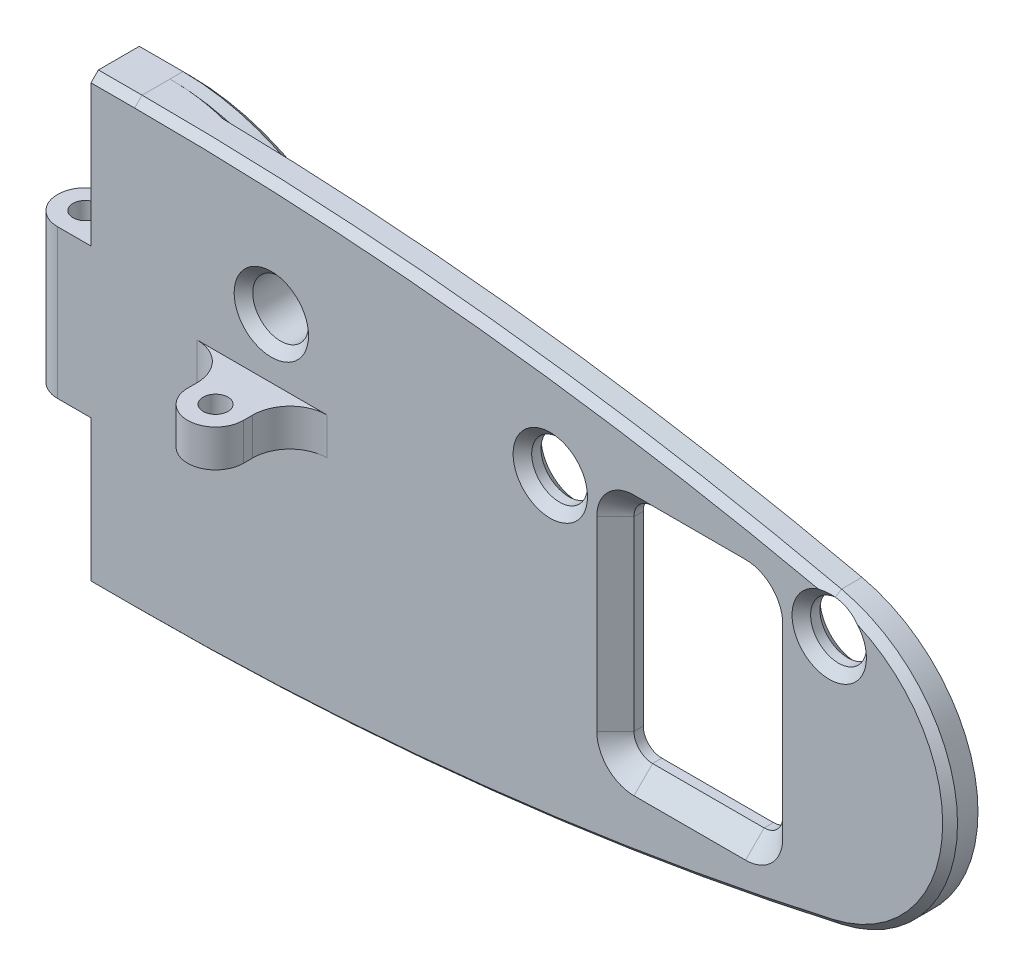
ISO-10303-21;
HEADER;
FILE_DESCRIPTION(('STEP AP214'),'2;1');
FILE_NAME('part.step','',(''),(''),'','','');
FILE_SCHEMA(('AUTOMOTIVE_DESIGN { 1 0 10303 214 1 1 1 1 }'));
ENDSEC;
DATA;
#1=APPLICATION_CONTEXT('core data for automotive mechanical design processes');
#2=APPLICATION_PROTOCOL_DEFINITION('international standard','automotive_design',2000,#1);
#3=PRODUCT_CONTEXT('',#1,'mechanical');
#4=PRODUCT('Part','Part','',(#3));
#5=PRODUCT_RELATED_PRODUCT_CATEGORY('part','',(#4));
#6=PRODUCT_DEFINITION_FORMATION('','',#4);
#7=PRODUCT_DEFINITION_CONTEXT('part definition',#1,'design');
#8=PRODUCT_DEFINITION('design','',#6,#7);
#9=PRODUCT_DEFINITION_SHAPE('','',#8);
#10=(LENGTH_UNIT() NAMED_UNIT(*) SI_UNIT(.MILLI.,.METRE.));
#11=(NAMED_UNIT(*) PLANE_ANGLE_UNIT() SI_UNIT($,.RADIAN.));
#12=(NAMED_UNIT(*) SI_UNIT($,.STERADIAN.) SOLID_ANGLE_UNIT());
#13=UNCERTAINTY_MEASURE_WITH_UNIT(LENGTH_MEASURE(1.E-05),#10,'distance_accuracy_value','');
#14=(GEOMETRIC_REPRESENTATION_CONTEXT(3) GLOBAL_UNCERTAINTY_ASSIGNED_CONTEXT((#13)) GLOBAL_UNIT_ASSIGNED_CONTEXT((#10,
#11,#12)) REPRESENTATION_CONTEXT('',''));
#15=CARTESIAN_POINT('',(0.,0.,0.));
#16=DIRECTION('',(0.,0.,1.));
#17=DIRECTION('',(1.,0.,0.));
#18=AXIS2_PLACEMENT_3D('',#15,#16,#17);
#19=CARTESIAN_POINT('',(-5.23875,12.7,4.7625));
#20=DIRECTION('',(0.,-1.,0.));
#21=DIRECTION('',(0.,0.,-1.));
#22=AXIS2_PLACEMENT_3D('',#19,#20,#21);
#23=PLANE('',#22);
#24=CARTESIAN_POINT('',(-0.476249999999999,12.7,0.));
#25=DIRECTION('',(0.,1.,0.));
#26=DIRECTION('',(0.,0.,1.));
#27=AXIS2_PLACEMENT_3D('',#24,#25,#26);
#28=CIRCLE('',#27,2.1209);
#29=CARTESIAN_POINT('',(-0.476249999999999,12.7,2.1209));
#30=VERTEX_POINT('',#29);
#31=EDGE_CURVE('E319',#30,#30,#28,.T.);
#32=ORIENTED_EDGE('',*,*,#31,.F.);
#33=EDGE_LOOP('',(#32));
#34=FACE_BOUND('',#33,.T.);
#35=DIRECTION('',(-1.,0.,0.));
#36=VECTOR('',#35,1.);
#37=CARTESIAN_POINT('',(-5.23875,12.7,-4.7625));
#38=LINE('',#37,#36);
#39=CARTESIAN_POINT('',(5.23875,12.7,-4.7625));
#40=VERTEX_POINT('',#39);
#41=CARTESIAN_POINT('',(-0.47625,12.7,-4.7625));
#42=VERTEX_POINT('',#41);
#43=EDGE_CURVE('E336',#40,#42,#38,.T.);
#44=ORIENTED_EDGE('',*,*,#43,.T.);
#45=CARTESIAN_POINT('',(-0.47625,12.7,0.));
#46=DIRECTION('',(0.,-1.,0.));
#47=DIRECTION('',(0.,0.,-1.));
#48=AXIS2_PLACEMENT_3D('',#45,#46,#47);
#49=CIRCLE('',#48,4.7625);
#50=CARTESIAN_POINT('',(-5.23875,12.7,0.));
#51=VERTEX_POINT('',#50);
#52=EDGE_CURVE('E389',#42,#51,#49,.F.);
#53=ORIENTED_EDGE('',*,*,#52,.T.);
#54=CARTESIAN_POINT('',(-0.476250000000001,12.7,0.));
#55=DIRECTION('',(0.,-1.,0.));
#56=DIRECTION('',(0.,0.,-1.));
#57=AXIS2_PLACEMENT_3D('',#54,#55,#56);
#58=CIRCLE('',#57,4.7625);
#59=CARTESIAN_POINT('',(-0.476250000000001,12.7,4.7625));
#60=VERTEX_POINT('',#59);
#61=EDGE_CURVE('E387',#51,#60,#58,.F.);
#62=ORIENTED_EDGE('',*,*,#61,.T.);
#63=DIRECTION('',(-1.,0.,0.));
#64=VECTOR('',#63,1.);
#65=CARTESIAN_POINT('',(-5.23875,12.7,4.7625));
#66=LINE('',#65,#64);
#67=CARTESIAN_POINT('',(5.23875,12.7,4.7625));
#68=VERTEX_POINT('',#67);
#69=EDGE_CURVE('E339',#68,#60,#66,.T.);
#70=ORIENTED_EDGE('',*,*,#69,.F.);
#71=DIRECTION('',(0.,0.,-1.));
#72=VECTOR('',#71,1.);
#73=CARTESIAN_POINT('',(5.23875,12.7,4.7625));
#74=LINE('',#73,#72);
#75=EDGE_CURVE('E350',#68,#40,#74,.T.);
#76=ORIENTED_EDGE('',*,*,#75,.T.);
#77=EDGE_LOOP('',(#44,#53,#62,#70,#76));
#78=FACE_BOUND('',#77,.T.);
#79=ADVANCED_FACE('F40',(#34,#78),#23,.F.);
#80=CARTESIAN_POINT('',(-5.23875,-12.7,4.7625));
#81=DIRECTION('',(0.,1.,0.));
#82=DIRECTION('',(0.,0.,1.));
#83=AXIS2_PLACEMENT_3D('',#80,#81,#82);
#84=PLANE('',#83);
#85=CARTESIAN_POINT('',(-0.476249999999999,-12.7,0.));
#86=DIRECTION('',(0.,1.,0.));
#87=DIRECTION('',(0.,0.,1.));
#88=AXIS2_PLACEMENT_3D('',#85,#86,#87);
#89=CIRCLE('',#88,2.1209);
#90=CARTESIAN_POINT('',(-0.476249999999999,-12.7,2.1209));
#91=VERTEX_POINT('',#90);
#92=EDGE_CURVE('E322',#91,#91,#89,.T.);
#93=ORIENTED_EDGE('',*,*,#92,.T.);
#94=EDGE_LOOP('',(#93));
#95=FACE_BOUND('',#94,.T.);
#96=CARTESIAN_POINT('',(-0.476250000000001,-12.7,0.));
#97=DIRECTION('',(0.,1.,0.));
#98=DIRECTION('',(0.,0.,1.));
#99=AXIS2_PLACEMENT_3D('',#96,#97,#98);
#100=CIRCLE('',#99,4.7625);
#101=CARTESIAN_POINT('',(-0.476250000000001,-12.7,4.7625));
#102=VERTEX_POINT('',#101);
#103=CARTESIAN_POINT('',(-5.23875,-12.7,0.));
#104=VERTEX_POINT('',#103);
#105=EDGE_CURVE('E378',#102,#104,#100,.F.);
#106=ORIENTED_EDGE('',*,*,#105,.T.);
#107=CARTESIAN_POINT('',(-0.47625,-12.7,0.));
#108=DIRECTION('',(0.,1.,0.));
#109=DIRECTION('',(0.,0.,1.));
#110=AXIS2_PLACEMENT_3D('',#107,#108,#109);
#111=CIRCLE('',#110,4.7625);
#112=CARTESIAN_POINT('',(-0.47625,-12.7,-4.7625));
#113=VERTEX_POINT('',#112);
#114=EDGE_CURVE('E382',#104,#113,#111,.F.);
#115=ORIENTED_EDGE('',*,*,#114,.T.);
#116=DIRECTION('',(1.,0.,0.));
#117=VECTOR('',#116,1.);
#118=CARTESIAN_POINT('',(-5.23875,-12.7,-4.7625));
#119=LINE('',#118,#117);
#120=CARTESIAN_POINT('',(5.23875,-12.7,-4.7625));
#121=VERTEX_POINT('',#120);
#122=EDGE_CURVE('E353',#113,#121,#119,.T.);
#123=ORIENTED_EDGE('',*,*,#122,.T.);
#124=DIRECTION('',(0.,0.,-1.));
#125=VECTOR('',#124,1.);
#126=CARTESIAN_POINT('',(5.23875,-12.7,4.7625));
#127=LINE('',#126,#125);
#128=CARTESIAN_POINT('',(5.23875,-12.7,4.7625));
#129=VERTEX_POINT('',#128);
#130=EDGE_CURVE('E375',#129,#121,#127,.T.);
#131=ORIENTED_EDGE('',*,*,#130,.F.);
#132=DIRECTION('',(1.,0.,0.));
#133=VECTOR('',#132,1.);
#134=CARTESIAN_POINT('',(-5.23875,-12.7,4.7625));
#135=LINE('',#134,#133);
#136=EDGE_CURVE('E342',#102,#129,#135,.T.);
#137=ORIENTED_EDGE('',*,*,#136,.F.);
#138=EDGE_LOOP('',(#106,#115,#123,#131,#137));
#139=FACE_BOUND('',#138,.T.);
#140=ADVANCED_FACE('F509',(#95,#139),#84,.F.);
#141=CARTESIAN_POINT('',(5.23875,-12.7,4.7625));
#142=DIRECTION('',(1.,0.,0.));
#143=DIRECTION('',(0.,1.,0.));
#144=AXIS2_PLACEMENT_3D('',#141,#142,#143);
#145=PLANE('',#144);
#146=DIRECTION('',(0.,-1.,0.));
#147=VECTOR('',#146,1.);
#148=CARTESIAN_POINT('',(5.23875,-12.7,-4.7625));
#149=LINE('',#148,#147);
#150=CARTESIAN_POINT('',(5.23875,-36.8299999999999,-4.7625));
#151=VERTEX_POINT('',#150);
#152=EDGE_CURVE('E355',#121,#151,#149,.T.);
#153=ORIENTED_EDGE('',*,*,#152,.T.);
#154=DIRECTION('',(0.,-0.707106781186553,0.707106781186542));
#155=VECTOR('',#154,1.);
#156=CARTESIAN_POINT('',(5.23875,-38.1,-3.49249999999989));
#157=LINE('',#156,#155);
#158=CARTESIAN_POINT('',(5.23875,-38.1,-3.49249999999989));
#159=VERTEX_POINT('',#158);
#160=EDGE_CURVE('E421',#151,#159,#157,.T.);
#161=ORIENTED_EDGE('',*,*,#160,.T.);
#162=DIRECTION('',(0.,0.,-1.));
#163=VECTOR('',#162,1.);
#164=CARTESIAN_POINT('',(5.23875,-38.1,4.7625));
#165=LINE('',#164,#163);
#166=CARTESIAN_POINT('',(5.23875,-38.1,3.49250000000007));
#167=VERTEX_POINT('',#166);
#168=EDGE_CURVE('E372',#167,#159,#165,.T.);
#169=ORIENTED_EDGE('',*,*,#168,.F.);
#170=DIRECTION('',(0.,-0.707106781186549,-0.707106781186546));
#171=VECTOR('',#170,1.);
#172=CARTESIAN_POINT('',(5.23875,-36.8300000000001,4.7625));
#173=LINE('',#172,#171);
#174=CARTESIAN_POINT('',(5.23875,-36.8300000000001,4.7625));
#175=VERTEX_POINT('',#174);
#176=EDGE_CURVE('E419',#167,#175,#173,.F.);
#177=ORIENTED_EDGE('',*,*,#176,.T.);
#178=DIRECTION('',(0.,-1.,0.));
#179=VECTOR('',#178,1.);
#180=CARTESIAN_POINT('',(5.23875,-12.7,4.7625));
#181=LINE('',#180,#179);
#182=EDGE_CURVE('E345',#129,#175,#181,.T.);
#183=ORIENTED_EDGE('',*,*,#182,.F.);
#184=ORIENTED_EDGE('',*,*,#130,.T.);
#185=EDGE_LOOP('',(#153,#161,#169,#177,#183,#184));
#186=FACE_BOUND('',#185,.T.);
#187=ADVANCED_FACE('F505',(#186),#145,.F.);
#188=CARTESIAN_POINT('',(12.7,-38.1,4.7625));
#189=DIRECTION('',(0.,1.,0.));
#190=DIRECTION('',(-1.,0.,0.));
#191=AXIS2_PLACEMENT_3D('',#188,#189,#190);
#192=PLANE('',#191);
#193=ORIENTED_EDGE('',*,*,#168,.T.);
#194=DIRECTION('',(1.,0.,0.));
#195=VECTOR('',#194,1.);
#196=CARTESIAN_POINT('',(12.7,-38.1,-3.49249999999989));
#197=LINE('',#196,#195);
#198=CARTESIAN_POINT('',(12.7,-38.1,-3.49249999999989));
#199=VERTEX_POINT('',#198);
#200=EDGE_CURVE('E403',#159,#199,#197,.T.);
#201=ORIENTED_EDGE('',*,*,#200,.T.);
#202=DIRECTION('',(0.,0.,-1.));
#203=VECTOR('',#202,1.);
#204=CARTESIAN_POINT('',(12.7,-38.1,4.7625));
#205=LINE('',#204,#203);
#206=CARTESIAN_POINT('',(12.7,-38.1,-1.27000000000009));
#207=VERTEX_POINT('',#206);
#208=EDGE_CURVE('E368',#207,#199,#205,.T.);
#209=ORIENTED_EDGE('',*,*,#208,.F.);
#210=CARTESIAN_POINT('',(12.7,-38.1,3.49250000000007));
#211=VERTEX_POINT('',#210);
#212=EDGE_CURVE('E371',#211,#207,#205,.T.);
#213=ORIENTED_EDGE('',*,*,#212,.F.);
#214=DIRECTION('',(-1.,0.,0.));
#215=VECTOR('',#214,1.);
#216=CARTESIAN_POINT('',(12.7,-38.1,3.49250000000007));
#217=LINE('',#216,#215);
#218=EDGE_CURVE('E401',#211,#167,#217,.T.);
#219=ORIENTED_EDGE('',*,*,#218,.T.);
#220=EDGE_LOOP('',(#193,#201,#209,#213,#219));
#221=FACE_BOUND('',#220,.T.);
#222=ADVANCED_FACE('F501',(#221),#192,.F.);
#223=CARTESIAN_POINT('',(12.7,0.,4.7625));
#224=DIRECTION('',(0.,0.,-1.));
#225=DIRECTION('',(-1.,0.,0.));
#226=AXIS2_PLACEMENT_3D('',#223,#224,#225);
#227=CYLINDRICAL_SURFACE('',#226,38.1);
#228=DIRECTION('',(0.,0.,-1.));
#229=VECTOR('',#228,1.);
#230=CARTESIAN_POINT('',(12.7,38.1,4.7625));
#231=LINE('',#230,#229);
#232=CARTESIAN_POINT('',(12.7,38.1,-1.27000000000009));
#233=VERTEX_POINT('',#232);
#234=CARTESIAN_POINT('',(12.7,38.1,-3.49249999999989));
#235=VERTEX_POINT('',#234);
#236=EDGE_CURVE('E364',#233,#235,#231,.T.);
#237=ORIENTED_EDGE('',*,*,#236,.F.);
#238=CARTESIAN_POINT('',(12.7,0.,-1.2700000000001));
#239=DIRECTION('',(0.,0.,-1.));
#240=DIRECTION('',(-1.,0.,0.));
#241=AXIS2_PLACEMENT_3D('',#238,#239,#240);
#242=CIRCLE('',#241,38.1);
#243=EDGE_CURVE('E398',#233,#207,#242,.T.);
#244=ORIENTED_EDGE('',*,*,#243,.T.);
#245=ORIENTED_EDGE('',*,*,#208,.T.);
#246=CARTESIAN_POINT('',(12.7,0.,-3.49249999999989));
#247=DIRECTION('',(0.,0.,-1.));
#248=DIRECTION('',(-1.,0.,0.));
#249=AXIS2_PLACEMENT_3D('',#246,#247,#248);
#250=CIRCLE('',#249,38.1);
#251=EDGE_CURVE('E393',#199,#235,#250,.F.);
#252=ORIENTED_EDGE('',*,*,#251,.T.);
#253=EDGE_LOOP('',(#237,#244,#245,#252));
#254=FACE_BOUND('',#253,.T.);
#255=ADVANCED_FACE('F497',(#254),#227,.T.);
#256=CARTESIAN_POINT('',(12.7,38.1,4.7625));
#257=DIRECTION('',(0.,-1.,0.));
#258=DIRECTION('',(1.,0.,0.));
#259=AXIS2_PLACEMENT_3D('',#256,#257,#258);
#260=PLANE('',#259);
#261=ORIENTED_EDGE('',*,*,#236,.T.);
#262=DIRECTION('',(-1.,0.,0.));
#263=VECTOR('',#262,1.);
#264=CARTESIAN_POINT('',(5.23875,38.1,-3.49249999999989));
#265=LINE('',#264,#263);
#266=CARTESIAN_POINT('',(5.23875,38.1,-3.49249999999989));
#267=VERTEX_POINT('',#266);
#268=EDGE_CURVE('E411',#235,#267,#265,.T.);
#269=ORIENTED_EDGE('',*,*,#268,.T.);
#270=DIRECTION('',(0.,0.,-1.));
#271=VECTOR('',#270,1.);
#272=CARTESIAN_POINT('',(5.23875,38.1,4.7625));
#273=LINE('',#272,#271);
#274=CARTESIAN_POINT('',(5.23875,38.1,3.49250000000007));
#275=VERTEX_POINT('',#274);
#276=EDGE_CURVE('E361',#275,#267,#273,.T.);
#277=ORIENTED_EDGE('',*,*,#276,.F.);
#278=DIRECTION('',(1.,0.,0.));
#279=VECTOR('',#278,1.);
#280=CARTESIAN_POINT('',(12.7,38.1,3.49250000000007));
#281=LINE('',#280,#279);
#282=CARTESIAN_POINT('',(12.7,38.1,3.49250000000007));
#283=VERTEX_POINT('',#282);
#284=EDGE_CURVE('E408',#275,#283,#281,.T.);
#285=ORIENTED_EDGE('',*,*,#284,.T.);
#286=EDGE_CURVE('E367',#283,#233,#231,.T.);
#287=ORIENTED_EDGE('',*,*,#286,.T.);
#288=EDGE_LOOP('',(#261,#269,#277,#285,#287));
#289=FACE_BOUND('',#288,.T.);
#290=ADVANCED_FACE('F493',(#289),#260,.F.);
#291=CARTESIAN_POINT('',(5.23875,12.7,4.7625));
#292=DIRECTION('',(1.,0.,0.));
#293=DIRECTION('',(0.,1.,0.));
#294=AXIS2_PLACEMENT_3D('',#291,#292,#293);
#295=PLANE('',#294);
#296=ORIENTED_EDGE('',*,*,#276,.T.);
#297=DIRECTION('',(0.,-0.707106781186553,-0.707106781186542));
#298=VECTOR('',#297,1.);
#299=CARTESIAN_POINT('',(5.23875,38.1,-3.49249999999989));
#300=LINE('',#299,#298);
#301=CARTESIAN_POINT('',(5.23875,36.8299999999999,-4.7625));
#302=VERTEX_POINT('',#301);
#303=EDGE_CURVE('E425',#267,#302,#300,.T.);
#304=ORIENTED_EDGE('',*,*,#303,.T.);
#305=DIRECTION('',(0.,-1.,0.));
#306=VECTOR('',#305,1.);
#307=CARTESIAN_POINT('',(5.23875,12.7,-4.7625));
#308=LINE('',#307,#306);
#309=EDGE_CURVE('E343',#302,#40,#308,.T.);
#310=ORIENTED_EDGE('',*,*,#309,.T.);
#311=ORIENTED_EDGE('',*,*,#75,.F.);
#312=DIRECTION('',(0.,-1.,0.));
#313=VECTOR('',#312,1.);
#314=CARTESIAN_POINT('',(5.23875,12.7,4.7625));
#315=LINE('',#314,#313);
#316=CARTESIAN_POINT('',(5.23875,36.8300000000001,4.7625));
#317=VERTEX_POINT('',#316);
#318=EDGE_CURVE('E348',#317,#68,#315,.T.);
#319=ORIENTED_EDGE('',*,*,#318,.F.);
#320=DIRECTION('',(0.,-0.707106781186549,0.707106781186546));
#321=VECTOR('',#320,1.);
#322=CARTESIAN_POINT('',(5.23875,36.8300000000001,4.7625));
#323=LINE('',#322,#321);
#324=EDGE_CURVE('E423',#317,#275,#323,.F.);
#325=ORIENTED_EDGE('',*,*,#324,.T.);
#326=EDGE_LOOP('',(#296,#304,#310,#311,#319,#325));
#327=FACE_BOUND('',#326,.T.);
#328=ADVANCED_FACE('F486',(#327),#295,.F.);
#329=CARTESIAN_POINT('',(12.7,0.,4.7625));
#330=DIRECTION('',(0.,0.,-1.));
#331=DIRECTION('',(-1.,0.,0.));
#332=AXIS2_PLACEMENT_3D('',#329,#330,#331);
#333=PLANE('',#332);
#334=CARTESIAN_POINT('',(83.66125,18.00225,4.7625));
#335=DIRECTION('',(0.,0.,-1.));
#336=DIRECTION('',(-1.,0.,0.));
#337=AXIS2_PLACEMENT_3D('',#334,#335,#336);
#338=CIRCLE('',#337,6.35000000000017);
#339=CARTESIAN_POINT('',(77.3112499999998,18.00225,4.7625));
#340=VERTEX_POINT('',#339);
#341=EDGE_CURVE('E561',#340,#340,#338,.T.);
#342=ORIENTED_EDGE('',*,*,#341,.T.);
#343=EDGE_LOOP('',(#342));
#344=FACE_BOUND('',#343,.T.);
#345=CARTESIAN_POINT('',(36.03625,18.00225,4.7625));
#346=DIRECTION('',(0.,0.,-1.));
#347=DIRECTION('',(-1.,0.,0.));
#348=AXIS2_PLACEMENT_3D('',#345,#346,#347);
#349=CIRCLE('',#348,6.35000000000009);
#350=CARTESIAN_POINT('',(29.6862499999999,18.00225,4.7625));
#351=VERTEX_POINT('',#350);
#352=EDGE_CURVE('E564',#351,#351,#349,.T.);
#353=ORIENTED_EDGE('',*,*,#352,.T.);
#354=EDGE_LOOP('',(#353));
#355=FACE_BOUND('',#354,.T.);
#356=CARTESIAN_POINT('',(97.94875,-15.875,4.7625));
#357=DIRECTION('',(0.,0.,-1.));
#358=DIRECTION('',(-1.,0.,0.));
#359=AXIS2_PLACEMENT_3D('',#356,#357,#358);
#360=CIRCLE('',#359,6.34999999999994);
#361=CARTESIAN_POINT('',(97.94875,-22.2249999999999,4.7625));
#362=VERTEX_POINT('',#361);
#363=CARTESIAN_POINT('',(91.5987500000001,-15.875,4.7625));
#364=VERTEX_POINT('',#363);
#365=EDGE_CURVE('E680',#362,#364,#360,.T.);
#366=ORIENTED_EDGE('',*,*,#365,.T.);
#367=DIRECTION('',(0.,1.,0.));
#368=VECTOR('',#367,1.);
#369=CARTESIAN_POINT('',(91.5987500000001,0.,4.7625));
#370=LINE('',#369,#368);
#371=CARTESIAN_POINT('',(91.5987500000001,15.875,4.7625));
#372=VERTEX_POINT('',#371);
#373=EDGE_CURVE('E675',#364,#372,#370,.T.);
#374=ORIENTED_EDGE('',*,*,#373,.T.);
#375=CARTESIAN_POINT('',(97.94875,15.875,4.7625));
#376=DIRECTION('',(0.,0.,-1.));
#377=DIRECTION('',(-1.,0.,0.));
#378=AXIS2_PLACEMENT_3D('',#375,#376,#377);
#379=CIRCLE('',#378,6.34999999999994);
#380=CARTESIAN_POINT('',(97.94875,22.2249999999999,4.7625));
#381=VERTEX_POINT('',#380);
#382=EDGE_CURVE('E678',#372,#381,#379,.T.);
#383=ORIENTED_EDGE('',*,*,#382,.T.);
#384=DIRECTION('',(1.,0.,0.));
#385=VECTOR('',#384,1.);
#386=CARTESIAN_POINT('',(12.7,22.2249999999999,4.7625));
#387=LINE('',#386,#385);
#388=CARTESIAN_POINT('',(116.99875,22.2249999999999,4.7625));
#389=VERTEX_POINT('',#388);
#390=EDGE_CURVE('E682',#381,#389,#387,.T.);
#391=ORIENTED_EDGE('',*,*,#390,.T.);
#392=CARTESIAN_POINT('',(116.99875,15.875,4.7625));
#393=DIRECTION('',(0.,0.,-1.));
#394=DIRECTION('',(-1.,0.,0.));
#395=AXIS2_PLACEMENT_3D('',#392,#393,#394);
#396=CIRCLE('',#395,6.34999999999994);
#397=CARTESIAN_POINT('',(123.34875,15.875,4.7625));
#398=VERTEX_POINT('',#397);
#399=EDGE_CURVE('E686',#389,#398,#396,.T.);
#400=ORIENTED_EDGE('',*,*,#399,.T.);
#401=DIRECTION('',(0.,-1.,0.));
#402=VECTOR('',#401,1.);
#403=CARTESIAN_POINT('',(123.34875,0.,4.7625));
#404=LINE('',#403,#402);
#405=CARTESIAN_POINT('',(123.34875,-15.875,4.7625));
#406=VERTEX_POINT('',#405);
#407=EDGE_CURVE('E690',#398,#406,#404,.T.);
#408=ORIENTED_EDGE('',*,*,#407,.T.);
#409=CARTESIAN_POINT('',(116.99875,-15.875,4.7625));
#410=DIRECTION('',(0.,0.,-1.));
#411=DIRECTION('',(-1.,0.,0.));
#412=AXIS2_PLACEMENT_3D('',#409,#410,#411);
#413=CIRCLE('',#412,6.34999999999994);
#414=CARTESIAN_POINT('',(116.99875,-22.2249999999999,4.7625));
#415=VERTEX_POINT('',#414);
#416=EDGE_CURVE('E688',#406,#415,#413,.T.);
#417=ORIENTED_EDGE('',*,*,#416,.T.);
#418=DIRECTION('',(-1.,0.,0.));
#419=VECTOR('',#418,1.);
#420=CARTESIAN_POINT('',(12.7,-22.2249999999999,4.7625));
#421=LINE('',#420,#419);
#422=EDGE_CURVE('E684',#415,#362,#421,.T.);
#423=ORIENTED_EDGE('',*,*,#422,.T.);
#424=EDGE_LOOP('',(#366,#374,#383,#391,#400,#408,#417,#423));
#425=FACE_BOUND('',#424,.T.);
#426=DIRECTION('',(0.,-1.,0.));
#427=VECTOR('',#426,1.);
#428=CARTESIAN_POINT('',(45.56125,0.,4.7625));
#429=LINE('',#428,#427);
#430=CARTESIAN_POINT('',(45.56125,7.874,4.7625));
#431=VERTEX_POINT('',#430);
#432=CARTESIAN_POINT('',(45.56125,1.524,4.7625));
#433=VERTEX_POINT('',#432);
#434=EDGE_CURVE('E745',#431,#433,#429,.T.);
#435=ORIENTED_EDGE('',*,*,#434,.T.);
#436=DIRECTION('',(1.,0.,0.));
#437=VECTOR('',#436,1.);
#438=CARTESIAN_POINT('',(12.7,1.524,4.7625));
#439=LINE('',#438,#437);
#440=CARTESIAN_POINT('',(23.33625,1.524,4.7625));
#441=VERTEX_POINT('',#440);
#442=EDGE_CURVE('E753',#441,#433,#439,.T.);
#443=ORIENTED_EDGE('',*,*,#442,.F.);
#444=DIRECTION('',(0.,-1.,0.));
#445=VECTOR('',#444,1.);
#446=CARTESIAN_POINT('',(23.33625,7.874,4.7625));
#447=LINE('',#446,#445);
#448=CARTESIAN_POINT('',(23.33625,7.874,4.7625));
#449=VERTEX_POINT('',#448);
#450=EDGE_CURVE('E748',#441,#449,#447,.F.);
#451=ORIENTED_EDGE('',*,*,#450,.T.);
#452=DIRECTION('',(1.,0.,0.));
#453=VECTOR('',#452,1.);
#454=CARTESIAN_POINT('',(12.7,7.874,4.7625));
#455=LINE('',#454,#453);
#456=EDGE_CURVE('E751',#449,#431,#455,.T.);
#457=ORIENTED_EDGE('',*,*,#456,.T.);
#458=EDGE_LOOP('',(#435,#443,#451,#457));
#459=FACE_BOUND('',#458,.T.);
#460=CARTESIAN_POINT('',(126.52375,0.,4.7625));
#461=DIRECTION('',(0.,0.,-1.));
#462=DIRECTION('',(-1.,0.,0.));
#463=AXIS2_PLACEMENT_3D('',#460,#461,#462);
#464=CIRCLE('',#463,24.1300000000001);
#465=CARTESIAN_POINT('',(131.842197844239,-23.5365888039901,4.7625));
#466=VERTEX_POINT('',#465);
#467=CARTESIAN_POINT('',(136.093309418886,22.1513076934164,4.7625));
#468=VERTEX_POINT('',#467);
#469=EDGE_CURVE('E427',#466,#468,#464,.F.);
#470=ORIENTED_EDGE('',*,*,#469,.T.);
#471=CARTESIAN_POINT('',(131.28625,18.00225,4.7625));
#472=DIRECTION('',(0.,0.,-1.));
#473=DIRECTION('',(-1.,0.,0.));
#474=AXIS2_PLACEMENT_3D('',#471,#472,#473);
#475=CIRCLE('',#474,6.35000000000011);
#476=CARTESIAN_POINT('',(129.431875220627,24.0754529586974,4.7625));
#477=VERTEX_POINT('',#476);
#478=EDGE_CURVE('E560',#468,#477,#475,.T.);
#479=ORIENTED_EDGE('',*,*,#478,.T.);
#480=CARTESIAN_POINT('',(12.7,-503.7226796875,4.7625));
#481=DIRECTION('',(0.,0.,-1.));
#482=DIRECTION('',(-1.,0.,0.));
#483=AXIS2_PLACEMENT_3D('',#480,#481,#482);
#484=CIRCLE('',#483,540.5526796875);
#485=CARTESIAN_POINT('',(12.7,36.8300000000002,4.7625));
#486=VERTEX_POINT('',#485);
#487=EDGE_CURVE('E430',#477,#486,#484,.F.);
#488=ORIENTED_EDGE('',*,*,#487,.T.);
#489=DIRECTION('',(-1.,0.,0.));
#490=VECTOR('',#489,1.);
#491=CARTESIAN_POINT('',(12.7,36.8300000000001,4.7625));
#492=LINE('',#491,#490);
#493=EDGE_CURVE('E434',#486,#317,#492,.T.);
#494=ORIENTED_EDGE('',*,*,#493,.T.);
#495=ORIENTED_EDGE('',*,*,#318,.T.);
#496=ORIENTED_EDGE('',*,*,#69,.T.);
#497=DIRECTION('',(0.,-1.,0.));
#498=VECTOR('',#497,1.);
#499=CARTESIAN_POINT('',(-0.476250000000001,0.,4.7625));
#500=LINE('',#499,#498);
#501=EDGE_CURVE('E391',#60,#102,#500,.T.);
#502=ORIENTED_EDGE('',*,*,#501,.T.);
#503=ORIENTED_EDGE('',*,*,#136,.T.);
#504=ORIENTED_EDGE('',*,*,#182,.T.);
#505=DIRECTION('',(1.,0.,0.));
#506=VECTOR('',#505,1.);
#507=CARTESIAN_POINT('',(12.7,-36.8300000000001,4.7625));
#508=LINE('',#507,#506);
#509=CARTESIAN_POINT('',(12.7,-36.8300000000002,4.7625));
#510=VERTEX_POINT('',#509);
#511=EDGE_CURVE('E436',#175,#510,#508,.T.);
#512=ORIENTED_EDGE('',*,*,#511,.T.);
#513=CARTESIAN_POINT('',(12.7,503.7226796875,4.7625));
#514=DIRECTION('',(0.,0.,-1.));
#515=DIRECTION('',(-1.,0.,0.));
#516=AXIS2_PLACEMENT_3D('',#513,#514,#515);
#517=CIRCLE('',#516,540.5526796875);
#518=EDGE_CURVE('E432',#510,#466,#517,.F.);
#519=ORIENTED_EDGE('',*,*,#518,.T.);
#520=EDGE_LOOP('',(#470,#479,#488,#494,#495,#496,#502,#503,#504,#512,#519));
#521=FACE_BOUND('',#520,.T.);
#522=ADVANCED_FACE('F483',(#344,#355,#425,#459,#521),#333,.F.);
#523=CARTESIAN_POINT('',(12.7,0.,-4.7625));
#524=DIRECTION('',(0.,0.,-1.));
#525=DIRECTION('',(-1.,0.,0.));
#526=AXIS2_PLACEMENT_3D('',#523,#524,#525);
#527=PLANE('',#526);
#528=CARTESIAN_POINT('',(36.03625,18.00225,-4.7625));
#529=DIRECTION('',(0.,0.,-1.));
#530=DIRECTION('',(-1.,0.,0.));
#531=AXIS2_PLACEMENT_3D('',#528,#529,#530);
#532=CIRCLE('',#531,6.35000000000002);
#533=CARTESIAN_POINT('',(29.68625,18.00225,-4.7625));
#534=VERTEX_POINT('',#533);
#535=EDGE_CURVE('E631',#534,#534,#532,.F.);
#536=ORIENTED_EDGE('',*,*,#535,.T.);
#537=EDGE_LOOP('',(#536));
#538=FACE_BOUND('',#537,.T.);
#539=CARTESIAN_POINT('',(12.7,0.,-4.7625));
#540=DIRECTION('',(0.,0.,-1.));
#541=DIRECTION('',(-1.,0.,0.));
#542=AXIS2_PLACEMENT_3D('',#539,#540,#541);
#543=CIRCLE('',#542,36.8299999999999);
#544=CARTESIAN_POINT('',(12.7,36.8299999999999,-4.7625));
#545=VERTEX_POINT('',#544);
#546=CARTESIAN_POINT('',(12.7,-36.8299999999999,-4.7625));
#547=VERTEX_POINT('',#546);
#548=EDGE_CURVE('E413',#545,#547,#543,.T.);
#549=ORIENTED_EDGE('',*,*,#548,.T.);
#550=DIRECTION('',(-1.,0.,0.));
#551=VECTOR('',#550,1.);
#552=CARTESIAN_POINT('',(5.23875,-36.8299999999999,-4.7625));
#553=LINE('',#552,#551);
#554=EDGE_CURVE('E417',#547,#151,#553,.T.);
#555=ORIENTED_EDGE('',*,*,#554,.T.);
#556=ORIENTED_EDGE('',*,*,#152,.F.);
#557=ORIENTED_EDGE('',*,*,#122,.F.);
#558=DIRECTION('',(0.,-1.,0.));
#559=VECTOR('',#558,1.);
#560=CARTESIAN_POINT('',(-0.47625,12.7,-4.7625));
#561=LINE('',#560,#559);
#562=EDGE_CURVE('E384',#113,#42,#561,.F.);
#563=ORIENTED_EDGE('',*,*,#562,.T.);
#564=ORIENTED_EDGE('',*,*,#43,.F.);
#565=ORIENTED_EDGE('',*,*,#309,.F.);
#566=DIRECTION('',(1.,0.,0.));
#567=VECTOR('',#566,1.);
#568=CARTESIAN_POINT('',(12.7,36.8299999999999,-4.7625));
#569=LINE('',#568,#567);
#570=EDGE_CURVE('E415',#302,#545,#569,.T.);
#571=ORIENTED_EDGE('',*,*,#570,.T.);
#572=EDGE_LOOP('',(#549,#555,#556,#557,#563,#564,#565,#571));
#573=FACE_BOUND('',#572,.T.);
#574=ADVANCED_FACE('F481',(#538,#573),#527,.T.);
#575=CARTESIAN_POINT('',(126.52375,0.,0.));
#576=DIRECTION('',(0.,0.,1.));
#577=DIRECTION('',(1.,0.,0.));
#578=AXIS2_PLACEMENT_3D('',#575,#576,#577);
#579=CYLINDRICAL_SURFACE('',#578,25.4);
#580=DIRECTION('',(0.,0.,1.));
#581=VECTOR('',#580,1.);
#582=CARTESIAN_POINT('',(132.12211615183,24.7753566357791,0.));
#583=LINE('',#582,#581);
#584=CARTESIAN_POINT('',(132.12211615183,24.7753566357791,0.));
#585=VERTEX_POINT('',#584);
#586=CARTESIAN_POINT('',(132.12211615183,24.7753566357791,3.49250000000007));
#587=VERTEX_POINT('',#586);
#588=EDGE_CURVE('E332',#585,#587,#583,.T.);
#589=ORIENTED_EDGE('',*,*,#588,.T.);
#590=CARTESIAN_POINT('',(126.52375,0.,3.49250000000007));
#591=DIRECTION('',(0.,0.,-1.));
#592=DIRECTION('',(-1.,0.,0.));
#593=AXIS2_PLACEMENT_3D('',#590,#591,#592);
#594=CIRCLE('',#593,25.4);
#595=CARTESIAN_POINT('',(132.12211615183,-24.7753566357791,3.49250000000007));
#596=VERTEX_POINT('',#595);
#597=EDGE_CURVE('E444',#587,#596,#594,.T.);
#598=ORIENTED_EDGE('',*,*,#597,.T.);
#599=DIRECTION('',(0.,0.,1.));
#600=VECTOR('',#599,1.);
#601=CARTESIAN_POINT('',(132.12211615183,-24.7753566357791,0.));
#602=LINE('',#601,#600);
#603=CARTESIAN_POINT('',(132.12211615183,-24.7753566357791,0.));
#604=VERTEX_POINT('',#603);
#605=EDGE_CURVE('E333',#604,#596,#602,.T.);
#606=ORIENTED_EDGE('',*,*,#605,.F.);
#607=CARTESIAN_POINT('',(126.52375,0.,0.));
#608=DIRECTION('',(0.,0.,1.));
#609=DIRECTION('',(-1.,0.,0.));
#610=AXIS2_PLACEMENT_3D('',#607,#608,#609);
#611=CIRCLE('',#610,25.4);
#612=EDGE_CURVE('E324',#604,#585,#611,.T.);
#613=ORIENTED_EDGE('',*,*,#612,.T.);
#614=EDGE_LOOP('',(#589,#598,#606,#613));
#615=FACE_BOUND('',#614,.T.);
#616=ADVANCED_FACE('F471',(#615),#579,.T.);
#617=CARTESIAN_POINT('',(12.7,503.7226796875,0.));
#618=DIRECTION('',(0.,0.,1.));
#619=DIRECTION('',(1.,0.,0.));
#620=AXIS2_PLACEMENT_3D('',#617,#618,#619);
#621=CYLINDRICAL_SURFACE('',#620,541.8226796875);
#622=ORIENTED_EDGE('',*,*,#605,.T.);
#623=CARTESIAN_POINT('',(12.7,503.7226796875,3.49250000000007));
#624=DIRECTION('',(0.,0.,-1.));
#625=DIRECTION('',(-1.,0.,0.));
#626=AXIS2_PLACEMENT_3D('',#623,#624,#625);
#627=CIRCLE('',#626,541.8226796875);
#628=EDGE_CURVE('E439',#596,#211,#627,.T.);
#629=ORIENTED_EDGE('',*,*,#628,.T.);
#630=ORIENTED_EDGE('',*,*,#212,.T.);
#631=CARTESIAN_POINT('',(12.7,-38.1,-1.2700000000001));
#632=CARTESIAN_POINT('',(13.1337789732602,-38.1000007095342,-1.27001717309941));
#633=CARTESIAN_POINT('',(13.567552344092,-38.099479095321,-1.26311327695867));
#634=CARTESIAN_POINT('',(14.4346478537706,-38.0973965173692,-1.23559017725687));
#635=CARTESIAN_POINT('',(14.8679700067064,-38.0958355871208,-1.21497141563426));
#636=CARTESIAN_POINT('',(15.7321948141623,-38.0916871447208,-1.16024395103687));
#637=CARTESIAN_POINT('',(16.1631005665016,-38.0891033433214,-1.12618401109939));
#638=CARTESIAN_POINT('',(17.0236326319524,-38.082919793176,-1.04482538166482));
#639=CARTESIAN_POINT('',(17.4532589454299,-38.0793200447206,-0.997526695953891));
#640=CARTESIAN_POINT('',(18.7395010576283,-38.0670169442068,-0.836243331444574));
#641=CARTESIAN_POINT('',(19.5937662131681,-38.056808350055,-0.70285287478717));
#642=CARTESIAN_POINT('',(20.8697484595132,-38.0385717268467,-0.466249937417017));
#643=CARTESIAN_POINT('',(21.2949609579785,-38.0319905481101,-0.3811030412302));
#644=CARTESIAN_POINT('',(22.1428407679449,-38.0178750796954,-0.199160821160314));
#645=CARTESIAN_POINT('',(22.5655082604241,-38.0103408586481,-0.1023663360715));
#646=CARTESIAN_POINT('',(22.9868381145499,-38.0023402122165,0.));
#647=B_SPLINE_CURVE_WITH_KNOTS('',3,(#631,#632,#633,#634,#635,#636,#637,#638,#639,#640,#641,
#642,#643,#644,#645,#646),.UNSPECIFIED.,.F.,.F.,(4,2,2,2,2,2,2,4),(0.,1.30127185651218,
2.60250178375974,3.89905376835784,5.19560538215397,7.78784964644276,9.08883191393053,
10.3897205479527),.UNSPECIFIED.);
#648=CARTESIAN_POINT('',(22.9868381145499,-38.0023402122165,0.));
#649=VERTEX_POINT('',#648);
#650=EDGE_CURVE('E446',#207,#649,#647,.T.);
#651=ORIENTED_EDGE('',*,*,#650,.T.);
#652=CARTESIAN_POINT('',(12.7,503.7226796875,0.));
#653=DIRECTION('',(0.,0.,1.));
#654=DIRECTION('',(1.,0.,0.));
#655=AXIS2_PLACEMENT_3D('',#652,#653,#654);
#656=CIRCLE('',#655,541.8226796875);
#657=EDGE_CURVE('E330',#649,#604,#656,.T.);
#658=ORIENTED_EDGE('',*,*,#657,.T.);
#659=EDGE_LOOP('',(#622,#629,#630,#651,#658));
#660=FACE_BOUND('',#659,.T.);
#661=ADVANCED_FACE('F466',(#660),#621,.T.);
#662=CARTESIAN_POINT('',(12.7,-503.7226796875,0.));
#663=DIRECTION('',(0.,0.,1.));
#664=DIRECTION('',(1.,0.,0.));
#665=AXIS2_PLACEMENT_3D('',#662,#663,#664);
#666=CYLINDRICAL_SURFACE('',#665,541.8226796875);
#667=ORIENTED_EDGE('',*,*,#286,.F.);
#668=CARTESIAN_POINT('',(12.7,-503.7226796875,3.49250000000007));
#669=DIRECTION('',(0.,0.,-1.));
#670=DIRECTION('',(-1.,0.,0.));
#671=AXIS2_PLACEMENT_3D('',#668,#669,#670);
#672=CIRCLE('',#671,541.8226796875);
#673=EDGE_CURVE('E442',#283,#587,#672,.T.);
#674=ORIENTED_EDGE('',*,*,#673,.T.);
#675=ORIENTED_EDGE('',*,*,#588,.F.);
#676=CARTESIAN_POINT('',(12.7,-503.7226796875,0.));
#677=DIRECTION('',(0.,0.,1.));
#678=DIRECTION('',(-1.,0.,0.));
#679=AXIS2_PLACEMENT_3D('',#676,#677,#678);
#680=CIRCLE('',#679,541.8226796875);
#681=CARTESIAN_POINT('',(22.9868381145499,38.0023402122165,0.));
#682=VERTEX_POINT('',#681);
#683=EDGE_CURVE('E327',#585,#682,#680,.T.);
#684=ORIENTED_EDGE('',*,*,#683,.T.);
#685=CARTESIAN_POINT('',(22.9868381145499,38.0023402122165,0.));
#686=CARTESIAN_POINT('',(22.5655082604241,38.0103408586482,-0.102366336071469));
#687=CARTESIAN_POINT('',(22.1428407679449,38.0178750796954,-0.199160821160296));
#688=CARTESIAN_POINT('',(21.2949609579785,38.0319905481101,-0.381103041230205));
#689=CARTESIAN_POINT('',(20.8697484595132,38.0385717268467,-0.466249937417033));
#690=CARTESIAN_POINT('',(19.5937662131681,38.0568083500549,-0.702852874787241));
#691=CARTESIAN_POINT('',(18.7395010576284,38.0670169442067,-0.836243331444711));
#692=CARTESIAN_POINT('',(17.45325894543,38.0793200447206,-0.997526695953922));
#693=CARTESIAN_POINT('',(17.0236326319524,38.082919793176,-1.04482538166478));
#694=CARTESIAN_POINT('',(16.1631005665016,38.0891033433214,-1.12618401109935));
#695=CARTESIAN_POINT('',(15.7321948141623,38.0916871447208,-1.16024395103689));
#696=CARTESIAN_POINT('',(14.8679700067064,38.0958355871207,-1.21497141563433));
#697=CARTESIAN_POINT('',(14.4346478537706,38.0973965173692,-1.23559017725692));
#698=CARTESIAN_POINT('',(13.567552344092,38.099479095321,-1.26311327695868));
#699=CARTESIAN_POINT('',(13.1337789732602,38.1000007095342,-1.27001717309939));
#700=CARTESIAN_POINT('',(12.7,38.1,-1.27000000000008));
#701=B_SPLINE_CURVE_WITH_KNOTS('',3,(#685,#686,#687,#688,#689,#690,#691,#692,#693,#694,#695,
#696,#697,#698,#699,#700),.UNSPECIFIED.,.F.,.F.,(4,2,2,2,2,2,2,4),(0.,1.3008886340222,
2.60187090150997,5.19411516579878,6.4906667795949,7.787218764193,9.08844869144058,
10.3897205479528),.UNSPECIFIED.);
#702=EDGE_CURVE('E454',#682,#233,#701,.T.);
#703=ORIENTED_EDGE('',*,*,#702,.T.);
#704=EDGE_LOOP('',(#667,#674,#675,#684,#703));
#705=FACE_BOUND('',#704,.T.);
#706=ADVANCED_FACE('F470',(#705),#666,.T.);
#707=CARTESIAN_POINT('',(69.611875,251.86133984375,0.));
#708=DIRECTION('',(0.,0.,-1.));
#709=DIRECTION('',(-1.,0.,0.));
#710=AXIS2_PLACEMENT_3D('',#707,#708,#709);
#711=PLANE('',#710);
#712=CARTESIAN_POINT('',(83.66125,18.00225,0.));
#713=DIRECTION('',(0.,0.,-1.));
#714=DIRECTION('',(-1.,0.,0.));
#715=AXIS2_PLACEMENT_3D('',#712,#713,#714);
#716=CIRCLE('',#715,6.35000000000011);
#717=CARTESIAN_POINT('',(77.3112499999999,18.00225,0.));
#718=VERTEX_POINT('',#717);
#719=EDGE_CURVE('E615',#718,#718,#716,.F.);
#720=ORIENTED_EDGE('',*,*,#719,.T.);
#721=EDGE_LOOP('',(#720));
#722=FACE_BOUND('',#721,.T.);
#723=CARTESIAN_POINT('',(131.28625,18.00225,0.));
#724=DIRECTION('',(0.,0.,-1.));
#725=DIRECTION('',(-1.,0.,0.));
#726=AXIS2_PLACEMENT_3D('',#723,#724,#725);
#727=CIRCLE('',#726,6.35000000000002);
#728=CARTESIAN_POINT('',(124.93625,18.00225,0.));
#729=VERTEX_POINT('',#728);
#730=EDGE_CURVE('E606',#729,#729,#727,.F.);
#731=ORIENTED_EDGE('',*,*,#730,.T.);
#732=EDGE_LOOP('',(#731));
#733=FACE_BOUND('',#732,.T.);
#734=DIRECTION('',(0.,1.,0.));
#735=VECTOR('',#734,1.);
#736=CARTESIAN_POINT('',(94.77375,251.86133984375,0.));
#737=LINE('',#736,#735);
#738=CARTESIAN_POINT('',(94.77375,-15.875,0.));
#739=VERTEX_POINT('',#738);
#740=CARTESIAN_POINT('',(94.77375,15.875,0.));
#741=VERTEX_POINT('',#740);
#742=EDGE_CURVE('E720',#739,#741,#737,.T.);
#743=ORIENTED_EDGE('',*,*,#742,.F.);
#744=CARTESIAN_POINT('',(97.94875,-15.875,0.));
#745=DIRECTION('',(0.,0.,-1.));
#746=DIRECTION('',(-1.,0.,0.));
#747=AXIS2_PLACEMENT_3D('',#744,#745,#746);
#748=CIRCLE('',#747,3.175);
#749=CARTESIAN_POINT('',(97.94875,-19.05,0.));
#750=VERTEX_POINT('',#749);
#751=EDGE_CURVE('E698',#739,#750,#748,.F.);
#752=ORIENTED_EDGE('',*,*,#751,.T.);
#753=DIRECTION('',(-1.,0.,0.));
#754=VECTOR('',#753,1.);
#755=CARTESIAN_POINT('',(69.6118750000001,-19.05,0.));
#756=LINE('',#755,#754);
#757=CARTESIAN_POINT('',(116.99875,-19.05,0.));
#758=VERTEX_POINT('',#757);
#759=EDGE_CURVE('E729',#758,#750,#756,.T.);
#760=ORIENTED_EDGE('',*,*,#759,.F.);
#761=CARTESIAN_POINT('',(116.99875,-15.875,0.));
#762=DIRECTION('',(0.,0.,-1.));
#763=DIRECTION('',(-1.,0.,0.));
#764=AXIS2_PLACEMENT_3D('',#761,#762,#763);
#765=CIRCLE('',#764,3.175);
#766=CARTESIAN_POINT('',(120.17375,-15.875,0.));
#767=VERTEX_POINT('',#766);
#768=EDGE_CURVE('E696',#758,#767,#765,.F.);
#769=ORIENTED_EDGE('',*,*,#768,.T.);
#770=DIRECTION('',(0.,-1.,0.));
#771=VECTOR('',#770,1.);
#772=CARTESIAN_POINT('',(120.17375,251.86133984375,0.));
#773=LINE('',#772,#771);
#774=CARTESIAN_POINT('',(120.17375,15.875,0.));
#775=VERTEX_POINT('',#774);
#776=EDGE_CURVE('E726',#775,#767,#773,.T.);
#777=ORIENTED_EDGE('',*,*,#776,.F.);
#778=CARTESIAN_POINT('',(116.99875,15.875,0.));
#779=DIRECTION('',(0.,0.,-1.));
#780=DIRECTION('',(-1.,0.,0.));
#781=AXIS2_PLACEMENT_3D('',#778,#779,#780);
#782=CIRCLE('',#781,3.175);
#783=CARTESIAN_POINT('',(116.99875,19.05,0.));
#784=VERTEX_POINT('',#783);
#785=EDGE_CURVE('E694',#775,#784,#782,.F.);
#786=ORIENTED_EDGE('',*,*,#785,.T.);
#787=DIRECTION('',(1.,0.,0.));
#788=VECTOR('',#787,1.);
#789=CARTESIAN_POINT('',(69.611875,19.05,0.));
#790=LINE('',#789,#788);
#791=CARTESIAN_POINT('',(97.94875,19.05,0.));
#792=VERTEX_POINT('',#791);
#793=EDGE_CURVE('E723',#792,#784,#790,.T.);
#794=ORIENTED_EDGE('',*,*,#793,.F.);
#795=CARTESIAN_POINT('',(97.94875,15.875,0.));
#796=DIRECTION('',(0.,0.,-1.));
#797=DIRECTION('',(-1.,0.,0.));
#798=AXIS2_PLACEMENT_3D('',#795,#796,#797);
#799=CIRCLE('',#798,3.175);
#800=EDGE_CURVE('E692',#792,#741,#799,.F.);
#801=ORIENTED_EDGE('',*,*,#800,.T.);
#802=EDGE_LOOP('',(#743,#752,#760,#769,#777,#786,#794,#801));
#803=FACE_BOUND('',#802,.T.);
#804=ORIENTED_EDGE('',*,*,#657,.F.);
#805=CARTESIAN_POINT('',(12.7,0.,0.));
#806=DIRECTION('',(0.,0.,-1.));
#807=DIRECTION('',(-1.,0.,0.));
#808=AXIS2_PLACEMENT_3D('',#805,#806,#807);
#809=CIRCLE('',#808,39.3700000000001);
#810=EDGE_CURVE('E406',#649,#682,#809,.F.);
#811=ORIENTED_EDGE('',*,*,#810,.T.);
#812=ORIENTED_EDGE('',*,*,#683,.F.);
#813=ORIENTED_EDGE('',*,*,#612,.F.);
#814=EDGE_LOOP('',(#804,#811,#812,#813));
#815=FACE_BOUND('',#814,.T.);
#816=ADVANCED_FACE('F473',(#722,#733,#803,#815),#711,.T.);
#817=CARTESIAN_POINT('',(-0.476249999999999,-38.1,0.));
#818=DIRECTION('',(0.,1.,0.));
#819=DIRECTION('',(0.,0.,1.));
#820=AXIS2_PLACEMENT_3D('',#817,#818,#819);
#821=CYLINDRICAL_SURFACE('',#820,2.1209);
#822=ORIENTED_EDGE('',*,*,#31,.T.);
#823=EDGE_LOOP('',(#822));
#824=FACE_BOUND('',#823,.T.);
#825=ORIENTED_EDGE('',*,*,#92,.F.);
#826=EDGE_LOOP('',(#825));
#827=FACE_BOUND('',#826,.T.);
#828=ADVANCED_FACE('F522',(#824,#827),#821,.F.);
#829=CARTESIAN_POINT('',(-0.476250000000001,0.,0.));
#830=DIRECTION('',(0.,-1.,0.));
#831=DIRECTION('',(0.,0.,-1.));
#832=AXIS2_PLACEMENT_3D('',#829,#830,#831);
#833=CYLINDRICAL_SURFACE('',#832,4.7625);
#834=ORIENTED_EDGE('',*,*,#501,.F.);
#835=ORIENTED_EDGE('',*,*,#61,.F.);
#836=DIRECTION('',(0.,-1.,0.));
#837=VECTOR('',#836,1.);
#838=CARTESIAN_POINT('',(-5.23875,-12.7,0.));
#839=LINE('',#838,#837);
#840=EDGE_CURVE('E323',#104,#51,#839,.F.);
#841=ORIENTED_EDGE('',*,*,#840,.F.);
#842=ORIENTED_EDGE('',*,*,#105,.F.);
#843=EDGE_LOOP('',(#834,#835,#841,#842));
#844=FACE_BOUND('',#843,.T.);
#845=ADVANCED_FACE('F519',(#844),#833,.T.);
#846=CARTESIAN_POINT('',(-0.47625,-12.7,0.));
#847=DIRECTION('',(0.,1.,0.));
#848=DIRECTION('',(0.,0.,1.));
#849=AXIS2_PLACEMENT_3D('',#846,#847,#848);
#850=CYLINDRICAL_SURFACE('',#849,4.7625);
#851=ORIENTED_EDGE('',*,*,#52,.F.);
#852=ORIENTED_EDGE('',*,*,#562,.F.);
#853=ORIENTED_EDGE('',*,*,#114,.F.);
#854=ORIENTED_EDGE('',*,*,#840,.T.);
#855=EDGE_LOOP('',(#851,#852,#853,#854));
#856=FACE_BOUND('',#855,.T.);
#857=ADVANCED_FACE('F517',(#856),#850,.T.);
#858=CARTESIAN_POINT('',(12.7,0.,-1.2700000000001));
#859=DIRECTION('',(0.,0.,1.));
#860=DIRECTION('',(1.,0.,0.));
#861=AXIS2_PLACEMENT_3D('',#858,#859,#860);
#862=CONICAL_SURFACE('',#861,38.1,0.785398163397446);
#863=ORIENTED_EDGE('',*,*,#702,.F.);
#864=ORIENTED_EDGE('',*,*,#810,.F.);
#865=ORIENTED_EDGE('',*,*,#650,.F.);
#866=ORIENTED_EDGE('',*,*,#243,.F.);
#867=EDGE_LOOP('',(#863,#864,#865,#866));
#868=FACE_BOUND('',#867,.T.);
#869=ADVANCED_FACE('F462',(#868),#862,.T.);
#870=CARTESIAN_POINT('',(12.7,38.1,-3.49249999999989));
#871=DIRECTION('',(0.,0.707106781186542,-0.707106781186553));
#872=DIRECTION('',(1.,0.,0.));
#873=AXIS2_PLACEMENT_3D('',#870,#871,#872);
#874=PLANE('',#873);
#875=ORIENTED_EDGE('',*,*,#303,.F.);
#876=ORIENTED_EDGE('',*,*,#268,.F.);
#877=DIRECTION('',(0.,0.707106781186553,0.707106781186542));
#878=VECTOR('',#877,1.);
#879=CARTESIAN_POINT('',(12.7,36.8299999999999,-4.7625));
#880=LINE('',#879,#878);
#881=EDGE_CURVE('E396',#545,#235,#880,.T.);
#882=ORIENTED_EDGE('',*,*,#881,.F.);
#883=ORIENTED_EDGE('',*,*,#570,.F.);
#884=EDGE_LOOP('',(#875,#876,#882,#883));
#885=FACE_BOUND('',#884,.T.);
#886=ADVANCED_FACE('F790',(#885),#874,.T.);
#887=CARTESIAN_POINT('',(12.7,0.,-3.49249999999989));
#888=DIRECTION('',(0.,0.,1.));
#889=DIRECTION('',(1.,0.,0.));
#890=AXIS2_PLACEMENT_3D('',#887,#888,#889);
#891=CONICAL_SURFACE('',#890,38.1,0.785398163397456);
#892=ORIENTED_EDGE('',*,*,#881,.T.);
#893=ORIENTED_EDGE('',*,*,#251,.F.);
#894=DIRECTION('',(0.,-0.707106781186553,0.707106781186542));
#895=VECTOR('',#894,1.);
#896=CARTESIAN_POINT('',(12.7,-36.8299999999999,-4.7625));
#897=LINE('',#896,#895);
#898=EDGE_CURVE('E758',#547,#199,#897,.T.);
#899=ORIENTED_EDGE('',*,*,#898,.F.);
#900=ORIENTED_EDGE('',*,*,#548,.F.);
#901=EDGE_LOOP('',(#892,#893,#899,#900));
#902=FACE_BOUND('',#901,.T.);
#903=ADVANCED_FACE('F771',(#902),#891,.T.);
#904=CARTESIAN_POINT('',(12.7,-38.1,-3.49249999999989));
#905=DIRECTION('',(0.,-0.707106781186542,-0.707106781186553));
#906=DIRECTION('',(-1.,0.,0.));
#907=AXIS2_PLACEMENT_3D('',#904,#905,#906);
#908=PLANE('',#907);
#909=ORIENTED_EDGE('',*,*,#160,.F.);
#910=ORIENTED_EDGE('',*,*,#554,.F.);
#911=ORIENTED_EDGE('',*,*,#898,.T.);
#912=ORIENTED_EDGE('',*,*,#200,.F.);
#913=EDGE_LOOP('',(#909,#910,#911,#912));
#914=FACE_BOUND('',#913,.T.);
#915=ADVANCED_FACE('F768',(#914),#908,.T.);
#916=CARTESIAN_POINT('',(12.7,36.8300000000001,4.7625));
#917=DIRECTION('',(0.,-0.707106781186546,-0.707106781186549));
#918=DIRECTION('',(-1.,0.,0.));
#919=AXIS2_PLACEMENT_3D('',#916,#917,#918);
#920=PLANE('',#919);
#921=ORIENTED_EDGE('',*,*,#324,.F.);
#922=ORIENTED_EDGE('',*,*,#493,.F.);
#923=DIRECTION('',(0.,-0.707106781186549,0.707106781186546));
#924=VECTOR('',#923,1.);
#925=CARTESIAN_POINT('',(12.7,38.1,3.49250000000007));
#926=LINE('',#925,#924);
#927=EDGE_CURVE('E755',#283,#486,#926,.T.);
#928=ORIENTED_EDGE('',*,*,#927,.F.);
#929=ORIENTED_EDGE('',*,*,#284,.F.);
#930=EDGE_LOOP('',(#921,#922,#928,#929));
#931=FACE_BOUND('',#930,.T.);
#932=ADVANCED_FACE('F798',(#931),#920,.F.);
#933=CARTESIAN_POINT('',(12.7,-503.7226796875,4.7625));
#934=DIRECTION('',(0.,0.,-1.));
#935=DIRECTION('',(-1.,0.,0.));
#936=AXIS2_PLACEMENT_3D('',#933,#934,#935);
#937=CONICAL_SURFACE('',#936,540.5526796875,0.785398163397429);
#938=ORIENTED_EDGE('',*,*,#487,.F.);
#939=CARTESIAN_POINT('',(129.431875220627,24.0754529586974,4.7625));
#940=CARTESIAN_POINT('',(129.63739604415,24.0835636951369,4.71019907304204));
#941=CARTESIAN_POINT('',(129.844268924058,24.0867928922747,4.66226178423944));
#942=CARTESIAN_POINT('',(130.258864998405,24.0829272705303,4.57605156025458));
#943=CARTESIAN_POINT('',(130.466579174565,24.0758825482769,4.53773279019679));
#944=CARTESIAN_POINT('',(130.88310832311,24.0509923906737,4.47116004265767));
#945=CARTESIAN_POINT('',(131.091923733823,24.0331422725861,4.44291043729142));
#946=CARTESIAN_POINT('',(131.405559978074,23.9979540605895,4.40847217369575));
#947=CARTESIAN_POINT('',(131.510436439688,23.9847790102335,4.39830006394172));
#948=CARTESIAN_POINT('',(131.720030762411,23.955594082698,4.38069455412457));
#949=CARTESIAN_POINT('',(131.824748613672,23.9395840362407,4.37326131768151));
#950=CARTESIAN_POINT('',(131.929320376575,23.9221462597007,4.36722175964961));
#951=B_SPLINE_CURVE_WITH_KNOTS('',3,(#939,#940,#941,#942,#943,#944,#945,#946,#947,#948,#949,
#950),.UNSPECIFIED.,.F.,.F.,(4,2,2,2,2,4),(0.,0.636639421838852,1.27018488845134,
1.90400511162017,2.2225086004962,2.54103111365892),.UNSPECIFIED.);
#952=CARTESIAN_POINT('',(131.929320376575,23.9221462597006,4.36722175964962));
#953=VERTEX_POINT('',#952);
#954=EDGE_CURVE('E55',#477,#953,#951,.T.);
#955=ORIENTED_EDGE('',*,*,#954,.T.);
#956=DIRECTION('',(-0.155852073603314,-0.68971742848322,0.707106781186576));
#957=VECTOR('',#956,1.);
#958=CARTESIAN_POINT('',(132.12211615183,24.775356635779,3.49250000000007));
#959=LINE('',#958,#957);
#960=EDGE_CURVE('E557',#587,#953,#959,.T.);
#961=ORIENTED_EDGE('',*,*,#960,.F.);
#962=ORIENTED_EDGE('',*,*,#673,.F.);
#963=ORIENTED_EDGE('',*,*,#927,.T.);
#964=EDGE_LOOP('',(#938,#955,#961,#962,#963));
#965=FACE_BOUND('',#964,.T.);
#966=ADVANCED_FACE('F573',(#965),#937,.T.);
#967=CARTESIAN_POINT('',(126.52375,0.,4.7625));
#968=DIRECTION('',(0.,0.,-1.));
#969=DIRECTION('',(-1.,0.,0.));
#970=AXIS2_PLACEMENT_3D('',#967,#968,#969);
#971=CONICAL_SURFACE('',#970,24.1300000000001,0.785398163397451);
#972=ORIENTED_EDGE('',*,*,#960,.T.);
#973=CARTESIAN_POINT('',(131.929320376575,23.9221462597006,4.36722175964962));
#974=CARTESIAN_POINT('',(132.043750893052,23.9030677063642,4.36061026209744));
#975=CARTESIAN_POINT('',(132.157893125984,23.8819014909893,4.35527683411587));
#976=CARTESIAN_POINT('',(132.385419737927,23.8354110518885,4.34718421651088));
#977=CARTESIAN_POINT('',(132.49880411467,23.8100868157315,4.34442503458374));
#978=CARTESIAN_POINT('',(132.837477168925,23.7279203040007,4.34003696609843));
#979=CARTESIAN_POINT('',(133.06135727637,23.664872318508,4.34229341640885));
#980=CARTESIAN_POINT('',(133.498824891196,23.5242869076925,4.35697235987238));
#981=CARTESIAN_POINT('',(133.712530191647,23.4470899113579,4.36917538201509));
#982=CARTESIAN_POINT('',(134.133256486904,23.2781041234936,4.40324412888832));
#983=CARTESIAN_POINT('',(134.340279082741,23.1863188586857,4.42510752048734));
#984=CARTESIAN_POINT('',(134.679387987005,23.0216852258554,4.46935849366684));
#985=CARTESIAN_POINT('',(134.813653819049,22.952586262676,4.48919103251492));
#986=CARTESIAN_POINT('',(135.078399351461,22.8085830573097,4.53287643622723));
#987=CARTESIAN_POINT('',(135.208878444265,22.7336778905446,4.55672994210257));
#988=CARTESIAN_POINT('',(135.467663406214,22.577272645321,4.60867163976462));
#989=CARTESIAN_POINT('',(135.595908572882,22.4956913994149,4.63681725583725));
#990=CARTESIAN_POINT('',(135.84797002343,22.3273178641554,4.69687827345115));
#991=CARTESIAN_POINT('',(135.97178751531,22.2405270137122,4.72879263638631));
#992=CARTESIAN_POINT('',(136.093309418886,22.1513076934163,4.76250000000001));
#993=B_SPLINE_CURVE_WITH_KNOTS('',3,(#973,#974,#975,#976,#977,#978,#979,#980,#981,#982,#983,
#984,#985,#986,#987,#988,#989,#990,#991,#992),.UNSPECIFIED.,.F.,.F.,(4,2,2,2,2,2,2,2,2,4),(0.,
0.348540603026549,0.697082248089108,1.39394842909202,2.0758416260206,2.75757022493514,
3.21427657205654,3.67105579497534,4.13459221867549,4.59800119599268),.UNSPECIFIED.);
#994=EDGE_CURVE('E11',#953,#468,#993,.T.);
#995=ORIENTED_EDGE('',*,*,#994,.T.);
#996=ORIENTED_EDGE('',*,*,#469,.F.);
#997=DIRECTION('',(-0.155852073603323,0.68971742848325,0.707106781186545));
#998=VECTOR('',#997,1.);
#999=CARTESIAN_POINT('',(132.12211615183,-24.775356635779,3.49250000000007));
#1000=LINE('',#999,#998);
#1001=EDGE_CURVE('E314',#596,#466,#1000,.T.);
#1002=ORIENTED_EDGE('',*,*,#1001,.F.);
#1003=ORIENTED_EDGE('',*,*,#597,.F.);
#1004=EDGE_LOOP('',(#972,#995,#996,#1002,#1003));
#1005=FACE_BOUND('',#1004,.T.);
#1006=ADVANCED_FACE('F555',(#1005),#971,.T.);
#1007=CARTESIAN_POINT('',(12.7,503.7226796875,4.7625));
#1008=DIRECTION('',(0.,0.,-1.));
#1009=DIRECTION('',(-1.,0.,0.));
#1010=AXIS2_PLACEMENT_3D('',#1007,#1008,#1009);
#1011=CONICAL_SURFACE('',#1010,540.5526796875,0.785398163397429);
#1012=ORIENTED_EDGE('',*,*,#1001,.T.);
#1013=ORIENTED_EDGE('',*,*,#518,.F.);
#1014=DIRECTION('',(0.,0.707106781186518,0.707106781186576));
#1015=VECTOR('',#1014,1.);
#1016=CARTESIAN_POINT('',(12.7,-38.1,3.49250000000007));
#1017=LINE('',#1016,#1015);
#1018=EDGE_CURVE('E312',#211,#510,#1017,.T.);
#1019=ORIENTED_EDGE('',*,*,#1018,.F.);
#1020=ORIENTED_EDGE('',*,*,#628,.F.);
#1021=EDGE_LOOP('',(#1012,#1013,#1019,#1020));
#1022=FACE_BOUND('',#1021,.T.);
#1023=ADVANCED_FACE('F551',(#1022),#1011,.T.);
#1024=CARTESIAN_POINT('',(12.7,-36.8300000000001,4.7625));
#1025=DIRECTION('',(0.,0.707106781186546,-0.707106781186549));
#1026=DIRECTION('',(1.,0.,0.));
#1027=AXIS2_PLACEMENT_3D('',#1024,#1025,#1026);
#1028=PLANE('',#1027);
#1029=ORIENTED_EDGE('',*,*,#176,.F.);
#1030=ORIENTED_EDGE('',*,*,#218,.F.);
#1031=ORIENTED_EDGE('',*,*,#1018,.T.);
#1032=ORIENTED_EDGE('',*,*,#511,.F.);
#1033=EDGE_LOOP('',(#1029,#1030,#1031,#1032));
#1034=FACE_BOUND('',#1033,.T.);
#1035=ADVANCED_FACE('F544',(#1034),#1028,.F.);
#1036=CARTESIAN_POINT('',(29.68625,7.874,0.));
#1037=DIRECTION('',(1.,0.,0.));
#1038=DIRECTION('',(0.,0.,-1.));
#1039=AXIS2_PLACEMENT_3D('',#1036,#1037,#1038);
#1040=PLANE('',#1039);
#1041=DIRECTION('',(0.,0.,1.));
#1042=VECTOR('',#1041,1.);
#1043=CARTESIAN_POINT('',(29.68625,7.874,0.));
#1044=LINE('',#1043,#1042);
#1045=CARTESIAN_POINT('',(29.68625,7.874,11.1125));
#1046=VERTEX_POINT('',#1045);
#1047=CARTESIAN_POINT('',(29.68625,7.874,12.7));
#1048=VERTEX_POINT('',#1047);
#1049=EDGE_CURVE('E285',#1046,#1048,#1044,.T.);
#1050=ORIENTED_EDGE('',*,*,#1049,.F.);
#1051=DIRECTION('',(0.,-1.,0.));
#1052=VECTOR('',#1051,1.);
#1053=CARTESIAN_POINT('',(29.68625,1.524,11.1125));
#1054=LINE('',#1053,#1052);
#1055=CARTESIAN_POINT('',(29.68625,1.524,11.1125));
#1056=VERTEX_POINT('',#1055);
#1057=EDGE_CURVE('E741',#1046,#1056,#1054,.T.);
#1058=ORIENTED_EDGE('',*,*,#1057,.T.);
#1059=DIRECTION('',(0.,0.,1.));
#1060=VECTOR('',#1059,1.);
#1061=CARTESIAN_POINT('',(29.68625,1.524,0.));
#1062=LINE('',#1061,#1060);
#1063=CARTESIAN_POINT('',(29.68625,1.524,12.7));
#1064=VERTEX_POINT('',#1063);
#1065=EDGE_CURVE('E310',#1056,#1064,#1062,.T.);
#1066=ORIENTED_EDGE('',*,*,#1065,.T.);
#1067=DIRECTION('',(0.,-1.,0.));
#1068=VECTOR('',#1067,1.);
#1069=CARTESIAN_POINT('',(29.68625,7.874,12.7));
#1070=LINE('',#1069,#1068);
#1071=EDGE_CURVE('E303',#1048,#1064,#1070,.T.);
#1072=ORIENTED_EDGE('',*,*,#1071,.F.);
#1073=EDGE_LOOP('',(#1050,#1058,#1066,#1072));
#1074=FACE_BOUND('',#1073,.T.);
#1075=ADVANCED_FACE('F308',(#1074),#1040,.F.);
#1076=CARTESIAN_POINT('',(39.21125,7.874,0.));
#1077=DIRECTION('',(1.,0.,0.));
#1078=DIRECTION('',(0.,0.,-1.));
#1079=AXIS2_PLACEMENT_3D('',#1076,#1077,#1078);
#1080=PLANE('',#1079);
#1081=DIRECTION('',(0.,0.,1.));
#1082=VECTOR('',#1081,1.);
#1083=CARTESIAN_POINT('',(39.21125,1.524,0.));
#1084=LINE('',#1083,#1082);
#1085=CARTESIAN_POINT('',(39.21125,1.524,11.1125));
#1086=VERTEX_POINT('',#1085);
#1087=CARTESIAN_POINT('',(39.21125,1.524,12.7));
#1088=VERTEX_POINT('',#1087);
#1089=EDGE_CURVE('E981',#1086,#1088,#1084,.T.);
#1090=ORIENTED_EDGE('',*,*,#1089,.F.);
#1091=DIRECTION('',(0.,-1.,0.));
#1092=VECTOR('',#1091,1.);
#1093=CARTESIAN_POINT('',(39.21125,7.874,11.1125));
#1094=LINE('',#1093,#1092);
#1095=CARTESIAN_POINT('',(39.21125,7.874,11.1125));
#1096=VERTEX_POINT('',#1095);
#1097=EDGE_CURVE('E743',#1086,#1096,#1094,.F.);
#1098=ORIENTED_EDGE('',*,*,#1097,.T.);
#1099=DIRECTION('',(0.,0.,1.));
#1100=VECTOR('',#1099,1.);
#1101=CARTESIAN_POINT('',(39.21125,7.874,0.));
#1102=LINE('',#1101,#1100);
#1103=CARTESIAN_POINT('',(39.21125,7.874,12.7));
#1104=VERTEX_POINT('',#1103);
#1105=EDGE_CURVE('E306',#1096,#1104,#1102,.T.);
#1106=ORIENTED_EDGE('',*,*,#1105,.T.);
#1107=DIRECTION('',(0.,-1.,0.));
#1108=VECTOR('',#1107,1.);
#1109=CARTESIAN_POINT('',(39.21125,7.874,12.7));
#1110=LINE('',#1109,#1108);
#1111=EDGE_CURVE('E305',#1104,#1088,#1110,.T.);
#1112=ORIENTED_EDGE('',*,*,#1111,.T.);
#1113=EDGE_LOOP('',(#1090,#1098,#1106,#1112));
#1114=FACE_BOUND('',#1113,.T.);
#1115=ADVANCED_FACE('F955',(#1114),#1080,.T.);
#1116=CARTESIAN_POINT('',(0.,7.874,0.));
#1117=DIRECTION('',(0.,1.,0.));
#1118=DIRECTION('',(0.,0.,1.));
#1119=AXIS2_PLACEMENT_3D('',#1116,#1117,#1118);
#1120=PLANE('',#1119);
#1121=CARTESIAN_POINT('',(34.44875,7.874,12.7));
#1122=DIRECTION('',(0.,1.,0.));
#1123=DIRECTION('',(0.,0.,1.));
#1124=AXIS2_PLACEMENT_3D('',#1121,#1122,#1123);
#1125=CIRCLE('',#1124,2.1209);
#1126=CARTESIAN_POINT('',(34.44875,7.874,14.8209));
#1127=VERTEX_POINT('',#1126);
#1128=EDGE_CURVE('E297',#1127,#1127,#1125,.T.);
#1129=ORIENTED_EDGE('',*,*,#1128,.F.);
#1130=EDGE_LOOP('',(#1129));
#1131=FACE_BOUND('',#1130,.T.);
#1132=ORIENTED_EDGE('',*,*,#456,.F.);
#1133=CARTESIAN_POINT('',(23.33625,7.874,11.1125));
#1134=DIRECTION('',(0.,1.,0.));
#1135=DIRECTION('',(0.,0.,1.));
#1136=AXIS2_PLACEMENT_3D('',#1133,#1134,#1135);
#1137=CIRCLE('',#1136,6.35);
#1138=EDGE_CURVE('E292',#449,#1046,#1137,.F.);
#1139=ORIENTED_EDGE('',*,*,#1138,.T.);
#1140=ORIENTED_EDGE('',*,*,#1049,.T.);
#1141=CARTESIAN_POINT('',(34.44875,7.874,12.7));
#1142=DIRECTION('',(0.,1.,0.));
#1143=DIRECTION('',(0.,0.,1.));
#1144=AXIS2_PLACEMENT_3D('',#1141,#1142,#1143);
#1145=CIRCLE('',#1144,4.7625);
#1146=EDGE_CURVE('E289',#1048,#1104,#1145,.T.);
#1147=ORIENTED_EDGE('',*,*,#1146,.T.);
#1148=ORIENTED_EDGE('',*,*,#1105,.F.);
#1149=CARTESIAN_POINT('',(45.56125,7.874,11.1125));
#1150=DIRECTION('',(0.,1.,0.));
#1151=DIRECTION('',(0.,0.,1.));
#1152=AXIS2_PLACEMENT_3D('',#1149,#1150,#1151);
#1153=CIRCLE('',#1152,6.35);
#1154=EDGE_CURVE('E736',#1096,#431,#1153,.F.);
#1155=ORIENTED_EDGE('',*,*,#1154,.T.);
#1156=EDGE_LOOP('',(#1132,#1139,#1140,#1147,#1148,#1155));
#1157=FACE_BOUND('',#1156,.T.);
#1158=ADVANCED_FACE('F287',(#1131,#1157),#1120,.T.);
#1159=CARTESIAN_POINT('',(0.,1.524,0.));
#1160=DIRECTION('',(0.,1.,0.));
#1161=DIRECTION('',(0.,0.,1.));
#1162=AXIS2_PLACEMENT_3D('',#1159,#1160,#1161);
#1163=PLANE('',#1162);
#1164=CARTESIAN_POINT('',(34.44875,1.524,12.7));
#1165=DIRECTION('',(0.,1.,0.));
#1166=DIRECTION('',(0.,0.,1.));
#1167=AXIS2_PLACEMENT_3D('',#1164,#1165,#1166);
#1168=CIRCLE('',#1167,2.1209);
#1169=CARTESIAN_POINT('',(34.44875,1.524,14.8209));
#1170=VERTEX_POINT('',#1169);
#1171=EDGE_CURVE('E639',#1170,#1170,#1168,.T.);
#1172=ORIENTED_EDGE('',*,*,#1171,.T.);
#1173=EDGE_LOOP('',(#1172));
#1174=FACE_BOUND('',#1173,.T.);
#1175=ORIENTED_EDGE('',*,*,#1065,.F.);
#1176=CARTESIAN_POINT('',(23.33625,1.524,11.1125));
#1177=DIRECTION('',(0.,1.,0.));
#1178=DIRECTION('',(0.,0.,1.));
#1179=AXIS2_PLACEMENT_3D('',#1176,#1177,#1178);
#1180=CIRCLE('',#1179,6.35);
#1181=EDGE_CURVE('E733',#1056,#441,#1180,.T.);
#1182=ORIENTED_EDGE('',*,*,#1181,.T.);
#1183=ORIENTED_EDGE('',*,*,#442,.T.);
#1184=CARTESIAN_POINT('',(45.56125,1.524,11.1125));
#1185=DIRECTION('',(0.,1.,0.));
#1186=DIRECTION('',(0.,0.,1.));
#1187=AXIS2_PLACEMENT_3D('',#1184,#1185,#1186);
#1188=CIRCLE('',#1187,6.35);
#1189=EDGE_CURVE('E739',#433,#1086,#1188,.T.);
#1190=ORIENTED_EDGE('',*,*,#1189,.T.);
#1191=ORIENTED_EDGE('',*,*,#1089,.T.);
#1192=CARTESIAN_POINT('',(34.44875,1.524,12.7));
#1193=DIRECTION('',(0.,1.,0.));
#1194=DIRECTION('',(0.,0.,1.));
#1195=AXIS2_PLACEMENT_3D('',#1192,#1193,#1194);
#1196=CIRCLE('',#1195,4.7625);
#1197=EDGE_CURVE('E977',#1064,#1088,#1196,.T.);
#1198=ORIENTED_EDGE('',*,*,#1197,.F.);
#1199=EDGE_LOOP('',(#1175,#1182,#1183,#1190,#1191,#1198));
#1200=FACE_BOUND('',#1199,.T.);
#1201=ADVANCED_FACE('F954',(#1174,#1200),#1163,.F.);
#1202=CARTESIAN_POINT('',(34.44875,7.874,12.7));
#1203=DIRECTION('',(0.,-1.,0.));
#1204=DIRECTION('',(0.,0.,-1.));
#1205=AXIS2_PLACEMENT_3D('',#1202,#1203,#1204);
#1206=CYLINDRICAL_SURFACE('',#1205,4.7625);
#1207=ORIENTED_EDGE('',*,*,#1197,.T.);
#1208=ORIENTED_EDGE('',*,*,#1111,.F.);
#1209=ORIENTED_EDGE('',*,*,#1146,.F.);
#1210=ORIENTED_EDGE('',*,*,#1071,.T.);
#1211=EDGE_LOOP('',(#1207,#1208,#1209,#1210));
#1212=FACE_BOUND('',#1211,.T.);
#1213=ADVANCED_FACE('F302',(#1212),#1206,.T.);
#1214=CARTESIAN_POINT('',(34.44875,7.874,12.7));
#1215=DIRECTION('',(0.,-1.,0.));
#1216=DIRECTION('',(0.,0.,-1.));
#1217=AXIS2_PLACEMENT_3D('',#1214,#1215,#1216);
#1218=CYLINDRICAL_SURFACE('',#1217,2.1209);
#1219=ORIENTED_EDGE('',*,*,#1128,.T.);
#1220=EDGE_LOOP('',(#1219));
#1221=FACE_BOUND('',#1220,.T.);
#1222=ORIENTED_EDGE('',*,*,#1171,.F.);
#1223=EDGE_LOOP('',(#1222));
#1224=FACE_BOUND('',#1223,.T.);
#1225=ADVANCED_FACE('F824',(#1221,#1224),#1218,.F.);
#1226=CARTESIAN_POINT('',(45.56125,0.,11.1125));
#1227=DIRECTION('',(0.,-1.,0.));
#1228=DIRECTION('',(0.,0.,-1.));
#1229=AXIS2_PLACEMENT_3D('',#1226,#1227,#1228);
#1230=CYLINDRICAL_SURFACE('',#1229,6.35);
#1231=ORIENTED_EDGE('',*,*,#1154,.F.);
#1232=ORIENTED_EDGE('',*,*,#1097,.F.);
#1233=ORIENTED_EDGE('',*,*,#1189,.F.);
#1234=ORIENTED_EDGE('',*,*,#434,.F.);
#1235=EDGE_LOOP('',(#1231,#1232,#1233,#1234));
#1236=FACE_BOUND('',#1235,.T.);
#1237=ADVANCED_FACE('F820',(#1236),#1230,.F.);
#1238=CARTESIAN_POINT('',(23.33625,7.874,11.1125));
#1239=DIRECTION('',(0.,1.,0.));
#1240=DIRECTION('',(0.,0.,1.));
#1241=AXIS2_PLACEMENT_3D('',#1238,#1239,#1240);
#1242=CYLINDRICAL_SURFACE('',#1241,6.35);
#1243=ORIENTED_EDGE('',*,*,#1138,.F.);
#1244=ORIENTED_EDGE('',*,*,#450,.F.);
#1245=ORIENTED_EDGE('',*,*,#1181,.F.);
#1246=ORIENTED_EDGE('',*,*,#1057,.F.);
#1247=EDGE_LOOP('',(#1243,#1244,#1245,#1246));
#1248=FACE_BOUND('',#1247,.T.);
#1249=ADVANCED_FACE('F823',(#1248),#1242,.F.);
#1250=CARTESIAN_POINT('',(94.77375,-19.05,-4.7625));
#1251=DIRECTION('',(-1.,0.,0.));
#1252=DIRECTION('',(0.,0.,1.));
#1253=AXIS2_PLACEMENT_3D('',#1250,#1251,#1252);
#1254=PLANE('',#1253);
#1255=DIRECTION('',(0.,0.,1.));
#1256=VECTOR('',#1255,1.);
#1257=CARTESIAN_POINT('',(94.77375,15.875,4.7625));
#1258=LINE('',#1257,#1256);
#1259=CARTESIAN_POINT('',(94.77375,15.875,1.58750000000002));
#1260=VERTEX_POINT('',#1259);
#1261=EDGE_CURVE('E712',#741,#1260,#1258,.T.);
#1262=ORIENTED_EDGE('',*,*,#1261,.T.);
#1263=DIRECTION('',(0.,-1.,0.));
#1264=VECTOR('',#1263,1.);
#1265=CARTESIAN_POINT('',(94.77375,-19.05,1.58750000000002));
#1266=LINE('',#1265,#1264);
#1267=CARTESIAN_POINT('',(94.77375,-15.875,1.58750000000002));
#1268=VERTEX_POINT('',#1267);
#1269=EDGE_CURVE('E672',#1260,#1268,#1266,.T.);
#1270=ORIENTED_EDGE('',*,*,#1269,.T.);
#1271=DIRECTION('',(0.,0.,1.));
#1272=VECTOR('',#1271,1.);
#1273=CARTESIAN_POINT('',(94.77375,-15.875,0.));
#1274=LINE('',#1273,#1272);
#1275=EDGE_CURVE('E710',#1268,#739,#1274,.F.);
#1276=ORIENTED_EDGE('',*,*,#1275,.T.);
#1277=ORIENTED_EDGE('',*,*,#742,.T.);
#1278=EDGE_LOOP('',(#1262,#1270,#1276,#1277));
#1279=FACE_BOUND('',#1278,.T.);
#1280=ADVANCED_FACE('F828',(#1279),#1254,.F.);
#1281=CARTESIAN_POINT('',(120.17375,19.05,-4.7625));
#1282=DIRECTION('',(0.,1.,0.));
#1283=DIRECTION('',(-1.,0.,0.));
#1284=AXIS2_PLACEMENT_3D('',#1281,#1282,#1283);
#1285=PLANE('',#1284);
#1286=DIRECTION('',(0.,0.,1.));
#1287=VECTOR('',#1286,1.);
#1288=CARTESIAN_POINT('',(116.99875,19.05,4.7625));
#1289=LINE('',#1288,#1287);
#1290=CARTESIAN_POINT('',(116.99875,19.05,1.58750000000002));
#1291=VERTEX_POINT('',#1290);
#1292=EDGE_CURVE('E700',#784,#1291,#1289,.T.);
#1293=ORIENTED_EDGE('',*,*,#1292,.T.);
#1294=DIRECTION('',(-1.,0.,0.));
#1295=VECTOR('',#1294,1.);
#1296=CARTESIAN_POINT('',(120.17375,19.05,1.58750000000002));
#1297=LINE('',#1296,#1295);
#1298=CARTESIAN_POINT('',(97.94875,19.05,1.58750000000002));
#1299=VERTEX_POINT('',#1298);
#1300=EDGE_CURVE('E666',#1291,#1299,#1297,.T.);
#1301=ORIENTED_EDGE('',*,*,#1300,.T.);
#1302=DIRECTION('',(0.,0.,1.));
#1303=VECTOR('',#1302,1.);
#1304=CARTESIAN_POINT('',(97.94875,19.05,0.));
#1305=LINE('',#1304,#1303);
#1306=EDGE_CURVE('E703',#1299,#792,#1305,.F.);
#1307=ORIENTED_EDGE('',*,*,#1306,.T.);
#1308=ORIENTED_EDGE('',*,*,#793,.T.);
#1309=EDGE_LOOP('',(#1293,#1301,#1307,#1308));
#1310=FACE_BOUND('',#1309,.T.);
#1311=ADVANCED_FACE('F938',(#1310),#1285,.F.);
#1312=CARTESIAN_POINT('',(120.17375,-19.05,-4.7625));
#1313=DIRECTION('',(1.,0.,0.));
#1314=DIRECTION('',(0.,0.,-1.));
#1315=AXIS2_PLACEMENT_3D('',#1312,#1313,#1314);
#1316=PLANE('',#1315);
#1317=DIRECTION('',(0.,0.,1.));
#1318=VECTOR('',#1317,1.);
#1319=CARTESIAN_POINT('',(120.17375,-15.875,4.7625));
#1320=LINE('',#1319,#1318);
#1321=CARTESIAN_POINT('',(120.17375,-15.875,1.58750000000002));
#1322=VERTEX_POINT('',#1321);
#1323=EDGE_CURVE('E705',#767,#1322,#1320,.T.);
#1324=ORIENTED_EDGE('',*,*,#1323,.T.);
#1325=DIRECTION('',(0.,1.,0.));
#1326=VECTOR('',#1325,1.);
#1327=CARTESIAN_POINT('',(120.17375,-19.05,1.58750000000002));
#1328=LINE('',#1327,#1326);
#1329=CARTESIAN_POINT('',(120.17375,15.875,1.58750000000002));
#1330=VERTEX_POINT('',#1329);
#1331=EDGE_CURVE('E633',#1322,#1330,#1328,.T.);
#1332=ORIENTED_EDGE('',*,*,#1331,.T.);
#1333=DIRECTION('',(0.,0.,1.));
#1334=VECTOR('',#1333,1.);
#1335=CARTESIAN_POINT('',(120.17375,15.875,0.));
#1336=LINE('',#1335,#1334);
#1337=EDGE_CURVE('E708',#1330,#775,#1336,.F.);
#1338=ORIENTED_EDGE('',*,*,#1337,.T.);
#1339=ORIENTED_EDGE('',*,*,#776,.T.);
#1340=EDGE_LOOP('',(#1324,#1332,#1338,#1339));
#1341=FACE_BOUND('',#1340,.T.);
#1342=ADVANCED_FACE('F941',(#1341),#1316,.F.);
#1343=CARTESIAN_POINT('',(120.17375,-19.05,-4.7625));
#1344=DIRECTION('',(0.,-1.,0.));
#1345=DIRECTION('',(1.,0.,0.));
#1346=AXIS2_PLACEMENT_3D('',#1343,#1344,#1345);
#1347=PLANE('',#1346);
#1348=DIRECTION('',(0.,0.,1.));
#1349=VECTOR('',#1348,1.);
#1350=CARTESIAN_POINT('',(97.94875,-19.05,4.7625));
#1351=LINE('',#1350,#1349);
#1352=CARTESIAN_POINT('',(97.94875,-19.05,1.58750000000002));
#1353=VERTEX_POINT('',#1352);
#1354=EDGE_CURVE('E715',#750,#1353,#1351,.T.);
#1355=ORIENTED_EDGE('',*,*,#1354,.T.);
#1356=DIRECTION('',(1.,0.,0.));
#1357=VECTOR('',#1356,1.);
#1358=CARTESIAN_POINT('',(120.17375,-19.05,1.58750000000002));
#1359=LINE('',#1358,#1357);
#1360=CARTESIAN_POINT('',(116.99875,-19.05,1.58750000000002));
#1361=VERTEX_POINT('',#1360);
#1362=EDGE_CURVE('E664',#1353,#1361,#1359,.T.);
#1363=ORIENTED_EDGE('',*,*,#1362,.T.);
#1364=DIRECTION('',(0.,0.,1.));
#1365=VECTOR('',#1364,1.);
#1366=CARTESIAN_POINT('',(116.99875,-19.05,0.));
#1367=LINE('',#1366,#1365);
#1368=EDGE_CURVE('E718',#1361,#758,#1367,.F.);
#1369=ORIENTED_EDGE('',*,*,#1368,.T.);
#1370=ORIENTED_EDGE('',*,*,#759,.T.);
#1371=EDGE_LOOP('',(#1355,#1363,#1369,#1370));
#1372=FACE_BOUND('',#1371,.T.);
#1373=ADVANCED_FACE('F834',(#1372),#1347,.F.);
#1374=CARTESIAN_POINT('',(97.94875,-15.875,-4.7625));
#1375=DIRECTION('',(0.,0.,-1.));
#1376=DIRECTION('',(-1.,0.,0.));
#1377=AXIS2_PLACEMENT_3D('',#1374,#1375,#1376);
#1378=CYLINDRICAL_SURFACE('',#1377,3.175);
#1379=ORIENTED_EDGE('',*,*,#1275,.F.);
#1380=CARTESIAN_POINT('',(97.94875,-15.875,1.58750000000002));
#1381=DIRECTION('',(0.,0.,-1.));
#1382=DIRECTION('',(-1.,0.,0.));
#1383=AXIS2_PLACEMENT_3D('',#1380,#1381,#1382);
#1384=CIRCLE('',#1383,3.175);
#1385=EDGE_CURVE('E668',#1268,#1353,#1384,.F.);
#1386=ORIENTED_EDGE('',*,*,#1385,.T.);
#1387=ORIENTED_EDGE('',*,*,#1354,.F.);
#1388=ORIENTED_EDGE('',*,*,#751,.F.);
#1389=EDGE_LOOP('',(#1379,#1386,#1387,#1388));
#1390=FACE_BOUND('',#1389,.T.);
#1391=ADVANCED_FACE('F830',(#1390),#1378,.F.);
#1392=CARTESIAN_POINT('',(116.99875,-15.875,-4.7625));
#1393=DIRECTION('',(0.,0.,-1.));
#1394=DIRECTION('',(-1.,0.,0.));
#1395=AXIS2_PLACEMENT_3D('',#1392,#1393,#1394);
#1396=CYLINDRICAL_SURFACE('',#1395,3.175);
#1397=ORIENTED_EDGE('',*,*,#1368,.F.);
#1398=CARTESIAN_POINT('',(116.99875,-15.875,1.58750000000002));
#1399=DIRECTION('',(0.,0.,-1.));
#1400=DIRECTION('',(-1.,0.,0.));
#1401=AXIS2_PLACEMENT_3D('',#1398,#1399,#1400);
#1402=CIRCLE('',#1401,3.175);
#1403=EDGE_CURVE('E660',#1361,#1322,#1402,.F.);
#1404=ORIENTED_EDGE('',*,*,#1403,.T.);
#1405=ORIENTED_EDGE('',*,*,#1323,.F.);
#1406=ORIENTED_EDGE('',*,*,#768,.F.);
#1407=EDGE_LOOP('',(#1397,#1404,#1405,#1406));
#1408=FACE_BOUND('',#1407,.T.);
#1409=ADVANCED_FACE('F833',(#1408),#1396,.F.);
#1410=CARTESIAN_POINT('',(116.99875,15.875,-4.7625));
#1411=DIRECTION('',(0.,0.,-1.));
#1412=DIRECTION('',(-1.,0.,0.));
#1413=AXIS2_PLACEMENT_3D('',#1410,#1411,#1412);
#1414=CYLINDRICAL_SURFACE('',#1413,3.175);
#1415=ORIENTED_EDGE('',*,*,#1337,.F.);
#1416=CARTESIAN_POINT('',(116.99875,15.875,1.58750000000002));
#1417=DIRECTION('',(0.,0.,-1.));
#1418=DIRECTION('',(-1.,0.,0.));
#1419=AXIS2_PLACEMENT_3D('',#1416,#1417,#1418);
#1420=CIRCLE('',#1419,3.175);
#1421=EDGE_CURVE('E662',#1330,#1291,#1420,.F.);
#1422=ORIENTED_EDGE('',*,*,#1421,.T.);
#1423=ORIENTED_EDGE('',*,*,#1292,.F.);
#1424=ORIENTED_EDGE('',*,*,#785,.F.);
#1425=EDGE_LOOP('',(#1415,#1422,#1423,#1424));
#1426=FACE_BOUND('',#1425,.T.);
#1427=ADVANCED_FACE('F838',(#1426),#1414,.F.);
#1428=CARTESIAN_POINT('',(97.94875,15.875,-4.7625));
#1429=DIRECTION('',(0.,0.,-1.));
#1430=DIRECTION('',(-1.,0.,0.));
#1431=AXIS2_PLACEMENT_3D('',#1428,#1429,#1430);
#1432=CYLINDRICAL_SURFACE('',#1431,3.175);
#1433=ORIENTED_EDGE('',*,*,#1306,.F.);
#1434=CARTESIAN_POINT('',(97.94875,15.875,1.58750000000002));
#1435=DIRECTION('',(0.,0.,-1.));
#1436=DIRECTION('',(-1.,0.,0.));
#1437=AXIS2_PLACEMENT_3D('',#1434,#1435,#1436);
#1438=CIRCLE('',#1437,3.175);
#1439=EDGE_CURVE('E670',#1299,#1260,#1438,.F.);
#1440=ORIENTED_EDGE('',*,*,#1439,.T.);
#1441=ORIENTED_EDGE('',*,*,#1261,.F.);
#1442=ORIENTED_EDGE('',*,*,#800,.F.);
#1443=EDGE_LOOP('',(#1433,#1440,#1441,#1442));
#1444=FACE_BOUND('',#1443,.T.);
#1445=ADVANCED_FACE('F842',(#1444),#1432,.F.);
#1446=CARTESIAN_POINT('',(131.28625,18.00225,-4.7625));
#1447=DIRECTION('',(0.,0.,1.));
#1448=DIRECTION('',(1.,0.,0.));
#1449=AXIS2_PLACEMENT_3D('',#1446,#1447,#1448);
#1450=CYLINDRICAL_SURFACE('',#1449,4.76250000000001);
#1451=CARTESIAN_POINT('',(131.28625,18.00225,1.58750000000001));
#1452=DIRECTION('',(0.,0.,-1.));
#1453=DIRECTION('',(-1.,0.,0.));
#1454=AXIS2_PLACEMENT_3D('',#1451,#1452,#1453);
#1455=CIRCLE('',#1454,4.76250000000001);
#1456=CARTESIAN_POINT('',(136.04875,18.00225,1.58750000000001));
#1457=VERTEX_POINT('',#1456);
#1458=EDGE_CURVE('E621',#1457,#1457,#1455,.T.);
#1459=CARTESIAN_POINT('',(131.28625,18.00225,3.17499999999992));
#1460=DIRECTION('',(0.,0.,-1.));
#1461=DIRECTION('',(-1.,0.,0.));
#1462=AXIS2_PLACEMENT_3D('',#1459,#1460,#1461);
#1463=CIRCLE('',#1462,4.76250000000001);
#1464=CARTESIAN_POINT('',(136.04875,18.00225,3.17499999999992));
#1465=VERTEX_POINT('',#1464);
#1466=EDGE_CURVE('E618',#1465,#1465,#1463,.F.);
#1467=CARTESIAN_POINT('',(136.04875,18.00225,1.58750000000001));
#1468=CARTESIAN_POINT('',(136.04875,18.00225,1.60403645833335));
#1469=CARTESIAN_POINT('',(136.04875,18.00225,1.62057291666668));
#1470=CARTESIAN_POINT('',(136.04875,18.00225,1.65364583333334));
#1471=CARTESIAN_POINT('',(136.04875,18.00225,1.67018229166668));
#1472=CARTESIAN_POINT('',(136.04875,18.00225,1.70325520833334));
#1473=CARTESIAN_POINT('',(136.04875,18.00225,1.71979166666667));
#1474=CARTESIAN_POINT('',(136.04875,18.00225,1.75286458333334));
#1475=CARTESIAN_POINT('',(136.04875,18.00225,1.76940104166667));
#1476=CARTESIAN_POINT('',(136.04875,18.00225,1.80247395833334));
#1477=CARTESIAN_POINT('',(136.04875,18.00225,1.81901041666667));
#1478=CARTESIAN_POINT('',(136.04875,18.00225,1.85208333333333));
#1479=CARTESIAN_POINT('',(136.04875,18.00225,1.86861979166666));
#1480=CARTESIAN_POINT('',(136.04875,18.00225,1.90169270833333));
#1481=CARTESIAN_POINT('',(136.04875,18.00225,1.91822916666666));
#1482=CARTESIAN_POINT('',(136.04875,18.00225,1.95130208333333));
#1483=CARTESIAN_POINT('',(136.04875,18.00225,1.96783854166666));
#1484=CARTESIAN_POINT('',(136.04875,18.00225,2.00091145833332));
#1485=CARTESIAN_POINT('',(136.04875,18.00225,2.01744791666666));
#1486=CARTESIAN_POINT('',(136.04875,18.00225,2.05052083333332));
#1487=CARTESIAN_POINT('',(136.04875,18.00225,2.06705729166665));
#1488=CARTESIAN_POINT('',(136.04875,18.00225,2.10013020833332));
#1489=CARTESIAN_POINT('',(136.04875,18.00225,2.11666666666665));
#1490=CARTESIAN_POINT('',(136.04875,18.00225,2.14973958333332));
#1491=CARTESIAN_POINT('',(136.04875,18.00225,2.16627604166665));
#1492=CARTESIAN_POINT('',(136.04875,18.00225,2.19934895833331));
#1493=CARTESIAN_POINT('',(136.04875,18.00225,2.21588541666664));
#1494=CARTESIAN_POINT('',(136.04875,18.00225,2.24895833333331));
#1495=CARTESIAN_POINT('',(136.04875,18.00225,2.26549479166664));
#1496=CARTESIAN_POINT('',(136.04875,18.00225,2.29856770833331));
#1497=CARTESIAN_POINT('',(136.04875,18.00225,2.31510416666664));
#1498=CARTESIAN_POINT('',(136.04875,18.00225,2.3481770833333));
#1499=CARTESIAN_POINT('',(136.04875,18.00225,2.36471354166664));
#1500=CARTESIAN_POINT('',(136.04875,18.00225,2.3977864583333));
#1501=CARTESIAN_POINT('',(136.04875,18.00225,2.41432291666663));
#1502=CARTESIAN_POINT('',(136.04875,18.00225,2.4473958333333));
#1503=CARTESIAN_POINT('',(136.04875,18.00225,2.46393229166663));
#1504=CARTESIAN_POINT('',(136.04875,18.00225,2.4970052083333));
#1505=CARTESIAN_POINT('',(136.04875,18.00225,2.51354166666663));
#1506=CARTESIAN_POINT('',(136.04875,18.00225,2.54661458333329));
#1507=CARTESIAN_POINT('',(136.04875,18.00225,2.56315104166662));
#1508=CARTESIAN_POINT('',(136.04875,18.00225,2.59622395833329));
#1509=CARTESIAN_POINT('',(136.04875,18.00225,2.61276041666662));
#1510=CARTESIAN_POINT('',(136.04875,18.00225,2.64583333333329));
#1511=CARTESIAN_POINT('',(136.04875,18.00225,2.66236979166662));
#1512=CARTESIAN_POINT('',(136.04875,18.00225,2.69544270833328));
#1513=CARTESIAN_POINT('',(136.04875,18.00225,2.71197916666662));
#1514=CARTESIAN_POINT('',(136.04875,18.00225,2.74505208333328));
#1515=CARTESIAN_POINT('',(136.04875,18.00225,2.76158854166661));
#1516=CARTESIAN_POINT('',(136.04875,18.00225,2.79466145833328));
#1517=CARTESIAN_POINT('',(136.04875,18.00225,2.81119791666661));
#1518=CARTESIAN_POINT('',(136.04875,18.00225,2.84427083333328));
#1519=CARTESIAN_POINT('',(136.04875,18.00225,2.86080729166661));
#1520=CARTESIAN_POINT('',(136.04875,18.00225,2.89388020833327));
#1521=CARTESIAN_POINT('',(136.04875,18.00225,2.9104166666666));
#1522=CARTESIAN_POINT('',(136.04875,18.00225,2.94348958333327));
#1523=CARTESIAN_POINT('',(136.04875,18.00225,2.9600260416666));
#1524=CARTESIAN_POINT('',(136.04875,18.00225,2.99309895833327));
#1525=CARTESIAN_POINT('',(136.04875,18.00225,3.0096354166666));
#1526=CARTESIAN_POINT('',(136.04875,18.00225,3.04270833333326));
#1527=CARTESIAN_POINT('',(136.04875,18.00225,3.0592447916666));
#1528=CARTESIAN_POINT('',(136.04875,18.00225,3.09231770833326));
#1529=CARTESIAN_POINT('',(136.04875,18.00225,3.10885416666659));
#1530=CARTESIAN_POINT('',(136.04875,18.00225,3.14192708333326));
#1531=CARTESIAN_POINT('',(136.04875,18.00225,3.15846354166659));
#1532=CARTESIAN_POINT('',(136.04875,18.00225,3.17499999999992));
#1533=B_SPLINE_CURVE_WITH_KNOTS('',3,(#1467,#1468,#1469,#1470,#1471,#1472,#1473,#1474,#1475,
#1476,#1477,#1478,#1479,#1480,#1481,#1482,#1483,#1484,#1485,#1486,#1487,#1488,#1489,#1490,#1491,
#1492,#1493,#1494,#1495,#1496,#1497,#1498,#1499,#1500,#1501,#1502,#1503,#1504,#1505,#1506,#1507,
#1508,#1509,#1510,#1511,#1512,#1513,#1514,#1515,#1516,#1517,#1518,#1519,#1520,#1521,#1522,#1523,
#1524,#1525,#1526,#1527,#1528,#1529,#1530,#1531,#1532),.UNSPECIFIED.,.F.,.F.,(4,2,2,2,2,2,2,2,2,
2,2,2,2,2,2,2,2,2,2,2,2,2,2,2,2,2,2,2,2,2,2,2,4),(0.,0.0496093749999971,0.0992187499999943,
0.148828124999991,0.198437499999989,0.248046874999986,0.297656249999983,0.34726562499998,
0.396874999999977,0.446484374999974,0.496093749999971,0.545703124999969,0.595312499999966,
0.644921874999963,0.69453124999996,0.744140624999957,0.793749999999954,0.843359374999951,
0.892968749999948,0.942578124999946,0.992187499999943,1.04179687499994,1.09140624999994,
1.14101562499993,1.19062499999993,1.24023437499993,1.28984374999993,1.33945312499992,
1.38906249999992,1.43867187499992,1.48828124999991,1.53789062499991,1.58749999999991),.UNSPECIFIED.);
#1534=EDGE_CURVE('BSEAM846',#1457,#1465,#1533,.T.);
#1535=ORIENTED_EDGE('',*,*,#1458,.T.);
#1536=ORIENTED_EDGE('',*,*,#1466,.T.);
#1537=ORIENTED_EDGE('',*,*,#1534,.T.);
#1538=ORIENTED_EDGE('',*,*,#1534,.F.);
#1539=EDGE_LOOP('',(#1535,#1537,#1536,#1538));
#1540=FACE_BOUND('',#1539,.T.);
#1541=ADVANCED_FACE('F846',(#1540),#1450,.F.);
#1542=CARTESIAN_POINT('',(83.66125,18.00225,-4.7625));
#1543=DIRECTION('',(0.,0.,1.));
#1544=DIRECTION('',(1.,0.,0.));
#1545=AXIS2_PLACEMENT_3D('',#1542,#1543,#1544);
#1546=CYLINDRICAL_SURFACE('',#1545,4.7625);
#1547=CARTESIAN_POINT('',(83.66125,18.00225,1.5875000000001));
#1548=DIRECTION('',(0.,0.,-1.));
#1549=DIRECTION('',(-1.,0.,0.));
#1550=AXIS2_PLACEMENT_3D('',#1547,#1548,#1549);
#1551=CIRCLE('',#1550,4.7625);
#1552=CARTESIAN_POINT('',(88.42375,18.00225,1.5875000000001));
#1553=VERTEX_POINT('',#1552);
#1554=EDGE_CURVE('E602',#1553,#1553,#1551,.T.);
#1555=CARTESIAN_POINT('',(83.66125,18.00225,3.17499999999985));
#1556=DIRECTION('',(0.,0.,-1.));
#1557=DIRECTION('',(-1.,0.,0.));
#1558=AXIS2_PLACEMENT_3D('',#1555,#1556,#1557);
#1559=CIRCLE('',#1558,4.7625);
#1560=CARTESIAN_POINT('',(88.42375,18.00225,3.17499999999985));
#1561=VERTEX_POINT('',#1560);
#1562=EDGE_CURVE('E600',#1561,#1561,#1559,.F.);
#1563=CARTESIAN_POINT('',(88.42375,18.00225,1.5875000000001));
#1564=CARTESIAN_POINT('',(88.42375,18.00225,1.60403645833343));
#1565=CARTESIAN_POINT('',(88.42375,18.00225,1.62057291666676));
#1566=CARTESIAN_POINT('',(88.42375,18.00225,1.65364583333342));
#1567=CARTESIAN_POINT('',(88.42375,18.00225,1.67018229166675));
#1568=CARTESIAN_POINT('',(88.42375,18.00225,1.70325520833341));
#1569=CARTESIAN_POINT('',(88.42375,18.00225,1.71979166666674));
#1570=CARTESIAN_POINT('',(88.42375,18.00225,1.75286458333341));
#1571=CARTESIAN_POINT('',(88.42375,18.00225,1.76940104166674));
#1572=CARTESIAN_POINT('',(88.42375,18.00225,1.8024739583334));
#1573=CARTESIAN_POINT('',(88.42375,18.00225,1.81901041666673));
#1574=CARTESIAN_POINT('',(88.42375,18.00225,1.85208333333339));
#1575=CARTESIAN_POINT('',(88.42375,18.00225,1.86861979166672));
#1576=CARTESIAN_POINT('',(88.42375,18.00225,1.90169270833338));
#1577=CARTESIAN_POINT('',(88.42375,18.00225,1.91822916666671));
#1578=CARTESIAN_POINT('',(88.42375,18.00225,1.95130208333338));
#1579=CARTESIAN_POINT('',(88.42375,18.00225,1.96783854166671));
#1580=CARTESIAN_POINT('',(88.42375,18.00225,2.00091145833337));
#1581=CARTESIAN_POINT('',(88.42375,18.00225,2.0174479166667));
#1582=CARTESIAN_POINT('',(88.42375,18.00225,2.05052083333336));
#1583=CARTESIAN_POINT('',(88.42375,18.00225,2.06705729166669));
#1584=CARTESIAN_POINT('',(88.42375,18.00225,2.10013020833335));
#1585=CARTESIAN_POINT('',(88.42375,18.00225,2.11666666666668));
#1586=CARTESIAN_POINT('',(88.42375,18.00225,2.14973958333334));
#1587=CARTESIAN_POINT('',(88.42375,18.00225,2.16627604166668));
#1588=CARTESIAN_POINT('',(88.42375,18.00225,2.19934895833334));
#1589=CARTESIAN_POINT('',(88.42375,18.00225,2.21588541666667));
#1590=CARTESIAN_POINT('',(88.42375,18.00225,2.24895833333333));
#1591=CARTESIAN_POINT('',(88.42375,18.00225,2.26549479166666));
#1592=CARTESIAN_POINT('',(88.42375,18.00225,2.29856770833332));
#1593=CARTESIAN_POINT('',(88.42375,18.00225,2.31510416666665));
#1594=CARTESIAN_POINT('',(88.42375,18.00225,2.34817708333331));
#1595=CARTESIAN_POINT('',(88.42375,18.00225,2.36471354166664));
#1596=CARTESIAN_POINT('',(88.42375,18.00225,2.39778645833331));
#1597=CARTESIAN_POINT('',(88.42375,18.00225,2.41432291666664));
#1598=CARTESIAN_POINT('',(88.42375,18.00225,2.4473958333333));
#1599=CARTESIAN_POINT('',(88.42375,18.00225,2.46393229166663));
#1600=CARTESIAN_POINT('',(88.42375,18.00225,2.49700520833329));
#1601=CARTESIAN_POINT('',(88.42375,18.00225,2.51354166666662));
#1602=CARTESIAN_POINT('',(88.42375,18.00225,2.54661458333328));
#1603=CARTESIAN_POINT('',(88.42375,18.00225,2.56315104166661));
#1604=CARTESIAN_POINT('',(88.42375,18.00225,2.59622395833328));
#1605=CARTESIAN_POINT('',(88.42375,18.00225,2.61276041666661));
#1606=CARTESIAN_POINT('',(88.42375,18.00225,2.64583333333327));
#1607=CARTESIAN_POINT('',(88.42375,18.00225,2.6623697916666));
#1608=CARTESIAN_POINT('',(88.42375,18.00225,2.69544270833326));
#1609=CARTESIAN_POINT('',(88.42375,18.00225,2.71197916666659));
#1610=CARTESIAN_POINT('',(88.42375,18.00225,2.74505208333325));
#1611=CARTESIAN_POINT('',(88.42375,18.00225,2.76158854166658));
#1612=CARTESIAN_POINT('',(88.42375,18.00225,2.79466145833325));
#1613=CARTESIAN_POINT('',(88.42375,18.00225,2.81119791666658));
#1614=CARTESIAN_POINT('',(88.42375,18.00225,2.84427083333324));
#1615=CARTESIAN_POINT('',(88.42375,18.00225,2.86080729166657));
#1616=CARTESIAN_POINT('',(88.42375,18.00225,2.89388020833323));
#1617=CARTESIAN_POINT('',(88.42375,18.00225,2.91041666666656));
#1618=CARTESIAN_POINT('',(88.42375,18.00225,2.94348958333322));
#1619=CARTESIAN_POINT('',(88.42375,18.00225,2.96002604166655));
#1620=CARTESIAN_POINT('',(88.42375,18.00225,2.99309895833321));
#1621=CARTESIAN_POINT('',(88.42375,18.00225,3.00963541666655));
#1622=CARTESIAN_POINT('',(88.42375,18.00225,3.04270833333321));
#1623=CARTESIAN_POINT('',(88.42375,18.00225,3.05924479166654));
#1624=CARTESIAN_POINT('',(88.42375,18.00225,3.0923177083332));
#1625=CARTESIAN_POINT('',(88.42375,18.00225,3.10885416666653));
#1626=CARTESIAN_POINT('',(88.42375,18.00225,3.14192708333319));
#1627=CARTESIAN_POINT('',(88.42375,18.00225,3.15846354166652));
#1628=CARTESIAN_POINT('',(88.42375,18.00225,3.17499999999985));
#1629=B_SPLINE_CURVE_WITH_KNOTS('',3,(#1563,#1564,#1565,#1566,#1567,#1568,#1569,#1570,#1571,
#1572,#1573,#1574,#1575,#1576,#1577,#1578,#1579,#1580,#1581,#1582,#1583,#1584,#1585,#1586,#1587,
#1588,#1589,#1590,#1591,#1592,#1593,#1594,#1595,#1596,#1597,#1598,#1599,#1600,#1601,#1602,#1603,
#1604,#1605,#1606,#1607,#1608,#1609,#1610,#1611,#1612,#1613,#1614,#1615,#1616,#1617,#1618,#1619,
#1620,#1621,#1622,#1623,#1624,#1625,#1626,#1627,#1628),.UNSPECIFIED.,.F.,.F.,(4,2,2,2,2,2,2,2,2,
2,2,2,2,2,2,2,2,2,2,2,2,2,2,2,2,2,2,2,2,2,2,2,4),(0.,0.0496093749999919,0.0992187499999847,
0.148828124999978,0.198437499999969,0.248046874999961,0.297656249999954,0.347265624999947,
0.396874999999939,0.446484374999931,0.496093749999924,0.545703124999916,0.595312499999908,
0.6449218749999,0.694531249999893,0.744140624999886,0.793749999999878,0.84335937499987,
0.892968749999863,0.942578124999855,0.992187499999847,1.04179687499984,1.09140624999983,
1.14101562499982,1.19062499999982,1.24023437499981,1.2898437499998,1.33945312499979,
1.38906249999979,1.43867187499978,1.48828124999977,1.53789062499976,1.58749999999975),.UNSPECIFIED.);
#1630=EDGE_CURVE('BSEAM926',#1553,#1561,#1629,.T.);
#1631=ORIENTED_EDGE('',*,*,#1554,.T.);
#1632=ORIENTED_EDGE('',*,*,#1562,.T.);
#1633=ORIENTED_EDGE('',*,*,#1630,.T.);
#1634=ORIENTED_EDGE('',*,*,#1630,.F.);
#1635=EDGE_LOOP('',(#1631,#1633,#1632,#1634));
#1636=FACE_BOUND('',#1635,.T.);
#1637=ADVANCED_FACE('F926',(#1636),#1546,.F.);
#1638=CARTESIAN_POINT('',(36.03625,18.00225,-4.7625));
#1639=DIRECTION('',(0.,0.,1.));
#1640=DIRECTION('',(1.,0.,0.));
#1641=AXIS2_PLACEMENT_3D('',#1638,#1639,#1640);
#1642=CYLINDRICAL_SURFACE('',#1641,4.7625);
#1643=CARTESIAN_POINT('',(36.03625,18.00225,-3.17499999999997));
#1644=DIRECTION('',(0.,0.,-1.));
#1645=DIRECTION('',(-1.,0.,0.));
#1646=AXIS2_PLACEMENT_3D('',#1643,#1644,#1645);
#1647=CIRCLE('',#1646,4.7625);
#1648=CARTESIAN_POINT('',(40.79875,18.00225,-3.17499999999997));
#1649=VERTEX_POINT('',#1648);
#1650=EDGE_CURVE('E603',#1649,#1649,#1647,.T.);
#1651=CARTESIAN_POINT('',(36.03625,18.00225,3.17499999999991));
#1652=DIRECTION('',(0.,0.,-1.));
#1653=DIRECTION('',(-1.,0.,0.));
#1654=AXIS2_PLACEMENT_3D('',#1651,#1652,#1653);
#1655=CIRCLE('',#1654,4.7625);
#1656=CARTESIAN_POINT('',(40.79875,18.00225,3.17499999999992));
#1657=VERTEX_POINT('',#1656);
#1658=EDGE_CURVE('E609',#1657,#1657,#1655,.F.);
#1659=CARTESIAN_POINT('',(40.79875,18.00225,-3.17499999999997));
#1660=CARTESIAN_POINT('',(40.79875,18.00225,-3.10885416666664));
#1661=CARTESIAN_POINT('',(40.79875,18.00225,-3.04270833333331));
#1662=CARTESIAN_POINT('',(40.79875,18.00225,-2.91041666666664));
#1663=CARTESIAN_POINT('',(40.79875,18.00225,-2.84427083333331));
#1664=CARTESIAN_POINT('',(40.79875,18.00225,-2.71197916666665));
#1665=CARTESIAN_POINT('',(40.79875,18.00225,-2.64583333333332));
#1666=CARTESIAN_POINT('',(40.79875,18.00225,-2.51354166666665));
#1667=CARTESIAN_POINT('',(40.79875,18.00225,-2.44739583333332));
#1668=CARTESIAN_POINT('',(40.79875,18.00225,-2.31510416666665));
#1669=CARTESIAN_POINT('',(40.79875,18.00225,-2.24895833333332));
#1670=CARTESIAN_POINT('',(40.79875,18.00225,-2.11666666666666));
#1671=CARTESIAN_POINT('',(40.79875,18.00225,-2.05052083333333));
#1672=CARTESIAN_POINT('',(40.79875,18.00225,-1.91822916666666));
#1673=CARTESIAN_POINT('',(40.79875,18.00225,-1.85208333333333));
#1674=CARTESIAN_POINT('',(40.79875,18.00225,-1.71979166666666));
#1675=CARTESIAN_POINT('',(40.79875,18.00225,-1.65364583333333));
#1676=CARTESIAN_POINT('',(40.79875,18.00225,-1.52135416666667));
#1677=CARTESIAN_POINT('',(40.79875,18.00225,-1.45520833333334));
#1678=CARTESIAN_POINT('',(40.79875,18.00225,-1.32291666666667));
#1679=CARTESIAN_POINT('',(40.79875,18.00225,-1.25677083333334));
#1680=CARTESIAN_POINT('',(40.79875,18.00225,-1.12447916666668));
#1681=CARTESIAN_POINT('',(40.79875,18.00225,-1.05833333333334));
#1682=CARTESIAN_POINT('',(40.79875,18.00225,-0.926041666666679));
#1683=CARTESIAN_POINT('',(40.79875,18.00225,-0.859895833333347));
#1684=CARTESIAN_POINT('',(40.79875,18.00225,-0.727604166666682));
#1685=CARTESIAN_POINT('',(40.79875,18.00225,-0.66145833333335));
#1686=CARTESIAN_POINT('',(40.79875,18.00225,-0.529166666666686));
#1687=CARTESIAN_POINT('',(40.79875,18.00225,-0.463020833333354));
#1688=CARTESIAN_POINT('',(40.79875,18.00225,-0.33072916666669));
#1689=CARTESIAN_POINT('',(40.79875,18.00225,-0.264583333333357));
#1690=CARTESIAN_POINT('',(40.79875,18.00225,-0.132291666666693));
#1691=CARTESIAN_POINT('',(40.79875,18.00225,-0.0661458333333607));
#1692=CARTESIAN_POINT('',(40.79875,18.00225,0.0661458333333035));
#1693=CARTESIAN_POINT('',(40.79875,18.00225,0.132291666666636));
#1694=CARTESIAN_POINT('',(40.79875,18.00225,0.2645833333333));
#1695=CARTESIAN_POINT('',(40.79875,18.00225,0.330729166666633));
#1696=CARTESIAN_POINT('',(40.79875,18.00225,0.463020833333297));
#1697=CARTESIAN_POINT('',(40.79875,18.00225,0.529166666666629));
#1698=CARTESIAN_POINT('',(40.79875,18.00225,0.661458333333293));
#1699=CARTESIAN_POINT('',(40.79875,18.00225,0.727604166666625));
#1700=CARTESIAN_POINT('',(40.79875,18.00225,0.85989583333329));
#1701=CARTESIAN_POINT('',(40.79875,18.00225,0.926041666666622));
#1702=CARTESIAN_POINT('',(40.79875,18.00225,1.05833333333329));
#1703=CARTESIAN_POINT('',(40.79875,18.00225,1.12447916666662));
#1704=CARTESIAN_POINT('',(40.79875,18.00225,1.25677083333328));
#1705=CARTESIAN_POINT('',(40.79875,18.00225,1.32291666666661));
#1706=CARTESIAN_POINT('',(40.79875,18.00225,1.45520833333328));
#1707=CARTESIAN_POINT('',(40.79875,18.00225,1.52135416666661));
#1708=CARTESIAN_POINT('',(40.79875,18.00225,1.65364583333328));
#1709=CARTESIAN_POINT('',(40.79875,18.00225,1.71979166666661));
#1710=CARTESIAN_POINT('',(40.79875,18.00225,1.85208333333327));
#1711=CARTESIAN_POINT('',(40.79875,18.00225,1.9182291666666));
#1712=CARTESIAN_POINT('',(40.79875,18.00225,2.05052083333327));
#1713=CARTESIAN_POINT('',(40.79875,18.00225,2.1166666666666));
#1714=CARTESIAN_POINT('',(40.79875,18.00225,2.24895833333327));
#1715=CARTESIAN_POINT('',(40.79875,18.00225,2.3151041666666));
#1716=CARTESIAN_POINT('',(40.79875,18.00225,2.44739583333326));
#1717=CARTESIAN_POINT('',(40.79875,18.00225,2.51354166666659));
#1718=CARTESIAN_POINT('',(40.79875,18.00225,2.64583333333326));
#1719=CARTESIAN_POINT('',(40.79875,18.00225,2.71197916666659));
#1720=CARTESIAN_POINT('',(40.79875,18.00225,2.84427083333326));
#1721=CARTESIAN_POINT('',(40.79875,18.00225,2.91041666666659));
#1722=CARTESIAN_POINT('',(40.79875,18.00225,3.04270833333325));
#1723=CARTESIAN_POINT('',(40.79875,18.00225,3.10885416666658));
#1724=CARTESIAN_POINT('',(40.79875,18.00225,3.17499999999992));
#1725=B_SPLINE_CURVE_WITH_KNOTS('',3,(#1659,#1660,#1661,#1662,#1663,#1664,#1665,#1666,#1667,
#1668,#1669,#1670,#1671,#1672,#1673,#1674,#1675,#1676,#1677,#1678,#1679,#1680,#1681,#1682,#1683,
#1684,#1685,#1686,#1687,#1688,#1689,#1690,#1691,#1692,#1693,#1694,#1695,#1696,#1697,#1698,#1699,
#1700,#1701,#1702,#1703,#1704,#1705,#1706,#1707,#1708,#1709,#1710,#1711,#1712,#1713,#1714,#1715,
#1716,#1717,#1718,#1719,#1720,#1721,#1722,#1723,#1724),.UNSPECIFIED.,.F.,.F.,(4,2,2,2,2,2,2,2,2,
2,2,2,2,2,2,2,2,2,2,2,2,2,2,2,2,2,2,2,2,2,2,2,4),(0.,0.198437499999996,0.396874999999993,
0.595312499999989,0.793749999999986,0.992187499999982,1.19062499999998,1.38906249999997,
1.58749999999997,1.78593749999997,1.98437499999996,2.18281249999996,2.38124999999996,
2.57968749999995,2.77812499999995,2.97656249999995,3.17499999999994,3.37343749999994,
3.57187499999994,3.77031249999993,3.96874999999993,4.16718749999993,4.36562499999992,
4.56406249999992,4.76249999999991,4.96093749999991,5.15937499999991,5.35781249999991,
5.5562499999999,5.7546874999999,5.9531249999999,6.15156249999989,6.34999999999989),.UNSPECIFIED.);
#1726=EDGE_CURVE('BSEAM906',#1649,#1657,#1725,.T.);
#1727=ORIENTED_EDGE('',*,*,#1650,.T.);
#1728=ORIENTED_EDGE('',*,*,#1658,.T.);
#1729=ORIENTED_EDGE('',*,*,#1726,.T.);
#1730=ORIENTED_EDGE('',*,*,#1726,.F.);
#1731=EDGE_LOOP('',(#1727,#1729,#1728,#1730));
#1732=FACE_BOUND('',#1731,.T.);
#1733=ADVANCED_FACE('F906',(#1732),#1642,.F.);
#1734=CARTESIAN_POINT('',(123.34875,0.,4.7625));
#1735=DIRECTION('',(0.707106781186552,0.,-0.707106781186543));
#1736=DIRECTION('',(0.,-1.,0.));
#1737=AXIS2_PLACEMENT_3D('',#1734,#1735,#1736);
#1738=PLANE('',#1737);
#1739=DIRECTION('',(0.707106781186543,0.,0.707106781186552));
#1740=VECTOR('',#1739,1.);
#1741=CARTESIAN_POINT('',(120.17375,15.875,1.58750000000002));
#1742=LINE('',#1741,#1740);
#1743=EDGE_CURVE('E640',#1330,#398,#1742,.T.);
#1744=ORIENTED_EDGE('',*,*,#1743,.F.);
#1745=ORIENTED_EDGE('',*,*,#1331,.F.);
#1746=DIRECTION('',(-0.707106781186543,0.,-0.707106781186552));
#1747=VECTOR('',#1746,1.);
#1748=CARTESIAN_POINT('',(123.34875,-15.875,4.7625));
#1749=LINE('',#1748,#1747);
#1750=EDGE_CURVE('E636',#406,#1322,#1749,.T.);
#1751=ORIENTED_EDGE('',*,*,#1750,.F.);
#1752=ORIENTED_EDGE('',*,*,#407,.F.);
#1753=EDGE_LOOP('',(#1744,#1745,#1751,#1752));
#1754=FACE_BOUND('',#1753,.T.);
#1755=ADVANCED_FACE('F899',(#1754),#1738,.F.);
#1756=CARTESIAN_POINT('',(116.99875,-15.875,4.7625));
#1757=DIRECTION('',(0.,0.,1.));
#1758=DIRECTION('',(1.,0.,0.));
#1759=AXIS2_PLACEMENT_3D('',#1756,#1757,#1758);
#1760=CONICAL_SURFACE('',#1759,6.34999999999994,0.785398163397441);
#1761=ORIENTED_EDGE('',*,*,#1750,.T.);
#1762=ORIENTED_EDGE('',*,*,#1403,.F.);
#1763=DIRECTION('',(0.,0.707106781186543,-0.707106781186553));
#1764=VECTOR('',#1763,1.);
#1765=CARTESIAN_POINT('',(116.99875,-22.2249999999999,4.7625));
#1766=LINE('',#1765,#1764);
#1767=EDGE_CURVE('E643',#415,#1361,#1766,.T.);
#1768=ORIENTED_EDGE('',*,*,#1767,.F.);
#1769=ORIENTED_EDGE('',*,*,#416,.F.);
#1770=EDGE_LOOP('',(#1761,#1762,#1768,#1769));
#1771=FACE_BOUND('',#1770,.T.);
#1772=ADVANCED_FACE('F892',(#1771),#1760,.F.);
#1773=CARTESIAN_POINT('',(116.99875,15.875,4.7625));
#1774=DIRECTION('',(0.,0.,1.));
#1775=DIRECTION('',(1.,0.,0.));
#1776=AXIS2_PLACEMENT_3D('',#1773,#1774,#1775);
#1777=CONICAL_SURFACE('',#1776,6.34999999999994,0.785398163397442);
#1778=ORIENTED_EDGE('',*,*,#1743,.T.);
#1779=ORIENTED_EDGE('',*,*,#399,.F.);
#1780=DIRECTION('',(0.,0.707106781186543,0.707106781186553));
#1781=VECTOR('',#1780,1.);
#1782=CARTESIAN_POINT('',(116.99875,19.05,1.58750000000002));
#1783=LINE('',#1782,#1781);
#1784=EDGE_CURVE('E646',#1291,#389,#1783,.T.);
#1785=ORIENTED_EDGE('',*,*,#1784,.F.);
#1786=ORIENTED_EDGE('',*,*,#1421,.F.);
#1787=EDGE_LOOP('',(#1778,#1779,#1785,#1786));
#1788=FACE_BOUND('',#1787,.T.);
#1789=ADVANCED_FACE('F885',(#1788),#1777,.F.);
#1790=CARTESIAN_POINT('',(12.7,-22.2249999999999,4.7625));
#1791=DIRECTION('',(0.,-0.707106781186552,-0.707106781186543));
#1792=DIRECTION('',(-1.,0.,0.));
#1793=AXIS2_PLACEMENT_3D('',#1790,#1791,#1792);
#1794=PLANE('',#1793);
#1795=ORIENTED_EDGE('',*,*,#1767,.T.);
#1796=ORIENTED_EDGE('',*,*,#1362,.F.);
#1797=DIRECTION('',(0.,0.707106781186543,-0.707106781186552));
#1798=VECTOR('',#1797,1.);
#1799=CARTESIAN_POINT('',(97.94875,-22.2249999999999,4.7625));
#1800=LINE('',#1799,#1798);
#1801=EDGE_CURVE('E649',#362,#1353,#1800,.T.);
#1802=ORIENTED_EDGE('',*,*,#1801,.F.);
#1803=ORIENTED_EDGE('',*,*,#422,.F.);
#1804=EDGE_LOOP('',(#1795,#1796,#1802,#1803));
#1805=FACE_BOUND('',#1804,.T.);
#1806=ADVANCED_FACE('F878',(#1805),#1794,.F.);
#1807=CARTESIAN_POINT('',(12.7,22.2249999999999,4.7625));
#1808=DIRECTION('',(0.,0.707106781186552,-0.707106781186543));
#1809=DIRECTION('',(1.,0.,0.));
#1810=AXIS2_PLACEMENT_3D('',#1807,#1808,#1809);
#1811=PLANE('',#1810);
#1812=ORIENTED_EDGE('',*,*,#1784,.T.);
#1813=ORIENTED_EDGE('',*,*,#390,.F.);
#1814=DIRECTION('',(0.,0.707106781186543,0.707106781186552));
#1815=VECTOR('',#1814,1.);
#1816=CARTESIAN_POINT('',(97.94875,19.05,1.58750000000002));
#1817=LINE('',#1816,#1815);
#1818=EDGE_CURVE('E652',#1299,#381,#1817,.T.);
#1819=ORIENTED_EDGE('',*,*,#1818,.F.);
#1820=ORIENTED_EDGE('',*,*,#1300,.F.);
#1821=EDGE_LOOP('',(#1812,#1813,#1819,#1820));
#1822=FACE_BOUND('',#1821,.T.);
#1823=ADVANCED_FACE('F871',(#1822),#1811,.F.);
#1824=CARTESIAN_POINT('',(97.94875,-15.875,4.7625));
#1825=DIRECTION('',(0.,0.,1.));
#1826=DIRECTION('',(1.,0.,0.));
#1827=AXIS2_PLACEMENT_3D('',#1824,#1825,#1826);
#1828=CONICAL_SURFACE('',#1827,6.34999999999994,0.785398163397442);
#1829=ORIENTED_EDGE('',*,*,#1801,.T.);
#1830=ORIENTED_EDGE('',*,*,#1385,.F.);
#1831=DIRECTION('',(0.707106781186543,0.,-0.707106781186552));
#1832=VECTOR('',#1831,1.);
#1833=CARTESIAN_POINT('',(91.5987500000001,-15.875,4.7625));
#1834=LINE('',#1833,#1832);
#1835=EDGE_CURVE('E655',#364,#1268,#1834,.T.);
#1836=ORIENTED_EDGE('',*,*,#1835,.F.);
#1837=ORIENTED_EDGE('',*,*,#365,.F.);
#1838=EDGE_LOOP('',(#1829,#1830,#1836,#1837));
#1839=FACE_BOUND('',#1838,.T.);
#1840=ADVANCED_FACE('F864',(#1839),#1828,.F.);
#1841=CARTESIAN_POINT('',(97.94875,15.875,4.7625));
#1842=DIRECTION('',(0.,0.,1.));
#1843=DIRECTION('',(1.,0.,0.));
#1844=AXIS2_PLACEMENT_3D('',#1841,#1842,#1843);
#1845=CONICAL_SURFACE('',#1844,6.34999999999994,0.785398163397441);
#1846=ORIENTED_EDGE('',*,*,#1818,.T.);
#1847=ORIENTED_EDGE('',*,*,#382,.F.);
#1848=DIRECTION('',(-0.707106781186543,0.,0.707106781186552));
#1849=VECTOR('',#1848,1.);
#1850=CARTESIAN_POINT('',(94.77375,15.875,1.58750000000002));
#1851=LINE('',#1850,#1849);
#1852=EDGE_CURVE('E657',#1260,#372,#1851,.T.);
#1853=ORIENTED_EDGE('',*,*,#1852,.F.);
#1854=ORIENTED_EDGE('',*,*,#1439,.F.);
#1855=EDGE_LOOP('',(#1846,#1847,#1853,#1854));
#1856=FACE_BOUND('',#1855,.T.);
#1857=ADVANCED_FACE('F857',(#1856),#1845,.F.);
#1858=CARTESIAN_POINT('',(91.5987500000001,0.,4.7625));
#1859=DIRECTION('',(-0.707106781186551,0.,-0.707106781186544));
#1860=DIRECTION('',(0.,1.,0.));
#1861=AXIS2_PLACEMENT_3D('',#1858,#1859,#1860);
#1862=PLANE('',#1861);
#1863=ORIENTED_EDGE('',*,*,#1835,.T.);
#1864=ORIENTED_EDGE('',*,*,#1269,.F.);
#1865=ORIENTED_EDGE('',*,*,#1852,.T.);
#1866=ORIENTED_EDGE('',*,*,#373,.F.);
#1867=EDGE_LOOP('',(#1863,#1864,#1865,#1866));
#1868=FACE_BOUND('',#1867,.T.);
#1869=ADVANCED_FACE('F849',(#1868),#1862,.F.);
#1870=CARTESIAN_POINT('',(36.03625,18.00225,-4.7625));
#1871=DIRECTION('',(0.,0.,-1.));
#1872=DIRECTION('',(-1.,0.,0.));
#1873=AXIS2_PLACEMENT_3D('',#1870,#1871,#1872);
#1874=CONICAL_SURFACE('',#1873,6.35000000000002,0.785398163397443);
#1875=ORIENTED_EDGE('',*,*,#1650,.F.);
#1876=EDGE_LOOP('',(#1875));
#1877=FACE_BOUND('',#1876,.T.);
#1878=ORIENTED_EDGE('',*,*,#535,.F.);
#1879=EDGE_LOOP('',(#1878));
#1880=FACE_BOUND('',#1879,.T.);
#1881=ADVANCED_FACE('F856',(#1877,#1880),#1874,.F.);
#1882=CARTESIAN_POINT('',(83.66125,18.00225,1.5875000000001));
#1883=DIRECTION('',(0.,0.,-1.));
#1884=DIRECTION('',(-1.,0.,0.));
#1885=AXIS2_PLACEMENT_3D('',#1882,#1883,#1884);
#1886=CONICAL_SURFACE('',#1885,4.7625,0.785398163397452);
#1887=ORIENTED_EDGE('',*,*,#719,.F.);
#1888=EDGE_LOOP('',(#1887));
#1889=FACE_BOUND('',#1888,.T.);
#1890=ORIENTED_EDGE('',*,*,#1554,.F.);
#1891=EDGE_LOOP('',(#1890));
#1892=FACE_BOUND('',#1891,.T.);
#1893=ADVANCED_FACE('F912',(#1889,#1892),#1886,.F.);
#1894=CARTESIAN_POINT('',(131.28625,18.00225,1.58750000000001));
#1895=DIRECTION('',(0.,0.,-1.));
#1896=DIRECTION('',(-1.,0.,0.));
#1897=AXIS2_PLACEMENT_3D('',#1894,#1895,#1896);
#1898=CONICAL_SURFACE('',#1897,4.76250000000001,0.785398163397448);
#1899=ORIENTED_EDGE('',*,*,#730,.F.);
#1900=EDGE_LOOP('',(#1899));
#1901=FACE_BOUND('',#1900,.T.);
#1902=ORIENTED_EDGE('',*,*,#1458,.F.);
#1903=EDGE_LOOP('',(#1902));
#1904=FACE_BOUND('',#1903,.T.);
#1905=ADVANCED_FACE('F585',(#1901,#1904),#1898,.F.);
#1906=CARTESIAN_POINT('',(131.28625,18.00225,3.17499999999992));
#1907=DIRECTION('',(0.,0.,1.));
#1908=DIRECTION('',(1.,0.,0.));
#1909=AXIS2_PLACEMENT_3D('',#1906,#1907,#1908);
#1910=CONICAL_SURFACE('',#1909,4.76250000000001,0.785398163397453);
#1911=ORIENTED_EDGE('',*,*,#954,.F.);
#1912=ORIENTED_EDGE('',*,*,#478,.F.);
#1913=ORIENTED_EDGE('',*,*,#994,.F.);
#1914=EDGE_LOOP('',(#1911,#1912,#1913));
#1915=FACE_BOUND('',#1914,.T.);
#1916=ORIENTED_EDGE('',*,*,#1466,.F.);
#1917=EDGE_LOOP('',(#1916));
#1918=FACE_BOUND('',#1917,.T.);
#1919=ADVANCED_FACE('F558',(#1915,#1918),#1910,.F.);
#1920=CARTESIAN_POINT('',(83.66125,18.00225,3.17499999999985));
#1921=DIRECTION('',(0.,0.,1.));
#1922=DIRECTION('',(1.,0.,0.));
#1923=AXIS2_PLACEMENT_3D('',#1920,#1921,#1922);
#1924=CONICAL_SURFACE('',#1923,4.7625,0.785398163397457);
#1925=ORIENTED_EDGE('',*,*,#341,.F.);
#1926=EDGE_LOOP('',(#1925));
#1927=FACE_BOUND('',#1926,.T.);
#1928=ORIENTED_EDGE('',*,*,#1562,.F.);
#1929=EDGE_LOOP('',(#1928));
#1930=FACE_BOUND('',#1929,.T.);
#1931=ADVANCED_FACE('F584',(#1927,#1930),#1924,.F.);
#1932=CARTESIAN_POINT('',(36.03625,18.00225,3.17499999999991));
#1933=DIRECTION('',(0.,0.,1.));
#1934=DIRECTION('',(1.,0.,0.));
#1935=AXIS2_PLACEMENT_3D('',#1932,#1933,#1934);
#1936=CONICAL_SURFACE('',#1935,4.7625,0.785398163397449);
#1937=ORIENTED_EDGE('',*,*,#352,.F.);
#1938=EDGE_LOOP('',(#1937));
#1939=FACE_BOUND('',#1938,.T.);
#1940=ORIENTED_EDGE('',*,*,#1658,.F.);
#1941=EDGE_LOOP('',(#1940));
#1942=FACE_BOUND('',#1941,.T.);
#1943=ADVANCED_FACE('F43',(#1939,#1942),#1936,.F.);
#1944=CLOSED_SHELL('',(#79,#140,#187,#222,#255,#290,#328,#522,#574,#616,#661,#706,#816,#828,
#845,#857,#869,#886,#903,#915,#932,#966,#1006,#1023,#1035,#1075,#1115,#1158,#1201,#1213,#1225,
#1237,#1249,#1280,#1311,#1342,#1373,#1391,#1409,#1427,#1445,#1541,#1637,#1733,#1755,#1772,#1789,
#1806,#1823,#1840,#1857,#1869,#1881,#1893,#1905,#1919,#1931,#1943));
#1945=MANIFOLD_SOLID_BREP('B2',#1944);
#1946=ADVANCED_BREP_SHAPE_REPRESENTATION('',(#18,#1945),#14);
#1947=SHAPE_DEFINITION_REPRESENTATION(#9,#1946);
ENDSEC;
END-ISO-10303-21;
